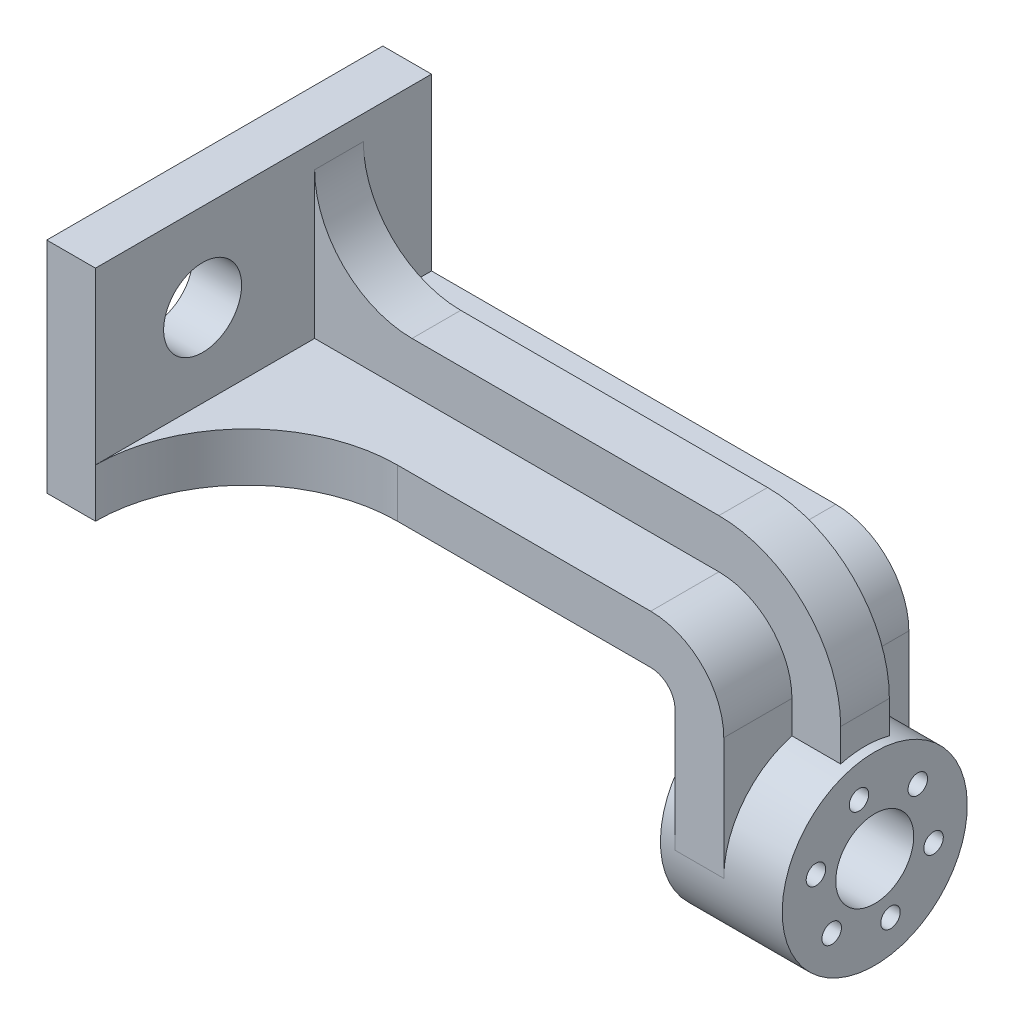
ISO-10303-21;
HEADER;
FILE_DESCRIPTION(('STEP AP214'),'2;1');
FILE_NAME('part.step','',(''),(''),'','','');
FILE_SCHEMA(('AUTOMOTIVE_DESIGN { 1 0 10303 214 1 1 1 1 }'));
ENDSEC;
DATA;
#1=APPLICATION_CONTEXT('core data for automotive mechanical design processes');
#2=APPLICATION_PROTOCOL_DEFINITION('international standard','automotive_design',2000,#1);
#3=PRODUCT_CONTEXT('',#1,'mechanical');
#4=PRODUCT('Part','Part','',(#3));
#5=PRODUCT_RELATED_PRODUCT_CATEGORY('part','',(#4));
#6=PRODUCT_DEFINITION_FORMATION('','',#4);
#7=PRODUCT_DEFINITION_CONTEXT('part definition',#1,'design');
#8=PRODUCT_DEFINITION('design','',#6,#7);
#9=PRODUCT_DEFINITION_SHAPE('','',#8);
#10=(LENGTH_UNIT() NAMED_UNIT(*) SI_UNIT(.MILLI.,.METRE.));
#11=(NAMED_UNIT(*) PLANE_ANGLE_UNIT() SI_UNIT($,.RADIAN.));
#12=(NAMED_UNIT(*) SI_UNIT($,.STERADIAN.) SOLID_ANGLE_UNIT());
#13=UNCERTAINTY_MEASURE_WITH_UNIT(LENGTH_MEASURE(1.E-05),#10,'distance_accuracy_value','');
#14=(GEOMETRIC_REPRESENTATION_CONTEXT(3) GLOBAL_UNCERTAINTY_ASSIGNED_CONTEXT((#13)) GLOBAL_UNIT_ASSIGNED_CONTEXT((#10,
#11,#12)) REPRESENTATION_CONTEXT('',''));
#15=CARTESIAN_POINT('',(0.,0.,0.));
#16=DIRECTION('',(0.,0.,1.));
#17=DIRECTION('',(1.,0.,0.));
#18=AXIS2_PLACEMENT_3D('',#15,#16,#17);
#19=CARTESIAN_POINT('',(108.,-52.5,3.49999999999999));
#20=DIRECTION('',(1.,0.,0.));
#21=DIRECTION('',(0.,1.,0.));
#22=AXIS2_PLACEMENT_3D('',#19,#20,#21);
#23=PLANE('',#22);
#24=CARTESIAN_POINT('',(108.,-52.5,-15.5));
#25=DIRECTION('',(1.,0.,0.));
#26=DIRECTION('',(0.,1.,0.));
#27=AXIS2_PLACEMENT_3D('',#24,#25,#26);
#28=CIRCLE('',#27,19.);
#29=CARTESIAN_POINT('',(108.,-34.1696972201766,-10.5));
#30=VERTEX_POINT('',#29);
#31=CARTESIAN_POINT('',(108.,-52.5,3.49999999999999));
#32=VERTEX_POINT('',#31);
#33=EDGE_CURVE('E278',#30,#32,#28,.T.);
#34=ORIENTED_EDGE('',*,*,#33,.F.);
#35=DIRECTION('',(0.,1.,0.));
#36=VECTOR('',#35,1.);
#37=CARTESIAN_POINT('',(108.,-52.5,-10.5));
#38=LINE('',#37,#36);
#39=CARTESIAN_POINT('',(108.,-27.5,-10.5));
#40=VERTEX_POINT('',#39);
#41=EDGE_CURVE('E208',#30,#40,#38,.T.);
#42=ORIENTED_EDGE('',*,*,#41,.T.);
#43=DIRECTION('',(0.,0.,-1.));
#44=VECTOR('',#43,1.);
#45=CARTESIAN_POINT('',(108.,-27.5,3.49999999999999));
#46=LINE('',#45,#44);
#47=CARTESIAN_POINT('',(108.,-27.5,3.49999999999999));
#48=VERTEX_POINT('',#47);
#49=EDGE_CURVE('E355',#40,#48,#46,.F.);
#50=ORIENTED_EDGE('',*,*,#49,.T.);
#51=DIRECTION('',(0.,-1.,0.));
#52=VECTOR('',#51,1.);
#53=CARTESIAN_POINT('',(108.,-52.5,3.49999999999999));
#54=LINE('',#53,#52);
#55=EDGE_CURVE('E288',#48,#32,#54,.T.);
#56=ORIENTED_EDGE('',*,*,#55,.T.);
#57=EDGE_LOOP('',(#34,#42,#50,#56));
#58=FACE_BOUND('',#57,.T.);
#59=ADVANCED_FACE('F34',(#58),#23,.T.);
#60=CARTESIAN_POINT('',(108.,-12.5,3.49999999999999));
#61=DIRECTION('',(0.,1.,0.));
#62=DIRECTION('',(0.,0.,1.));
#63=AXIS2_PLACEMENT_3D('',#60,#61,#62);
#64=PLANE('',#63);
#65=DIRECTION('',(0.,0.,-1.));
#66=VECTOR('',#65,1.);
#67=CARTESIAN_POINT('',(93.,-12.5,3.49999999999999));
#68=LINE('',#67,#66);
#69=CARTESIAN_POINT('',(93.,-12.5,3.49999999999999));
#70=VERTEX_POINT('',#69);
#71=CARTESIAN_POINT('',(93.,-12.5,-10.5));
#72=VERTEX_POINT('',#71);
#73=EDGE_CURVE('E350',#70,#72,#68,.T.);
#74=ORIENTED_EDGE('',*,*,#73,.T.);
#75=DIRECTION('',(-1.,0.,0.));
#76=VECTOR('',#75,1.);
#77=CARTESIAN_POINT('',(108.,-12.5,-10.5));
#78=LINE('',#77,#76);
#79=CARTESIAN_POINT('',(10.,-12.5,-10.5));
#80=VERTEX_POINT('',#79);
#81=EDGE_CURVE('E205',#72,#80,#78,.T.);
#82=ORIENTED_EDGE('',*,*,#81,.T.);
#83=DIRECTION('',(0.,0.,-1.));
#84=VECTOR('',#83,1.);
#85=CARTESIAN_POINT('',(10.,-12.5,3.49999999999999));
#86=LINE('',#85,#84);
#87=CARTESIAN_POINT('',(10.,-12.5,34.5));
#88=VERTEX_POINT('',#87);
#89=EDGE_CURVE('E311',#88,#80,#86,.T.);
#90=ORIENTED_EDGE('',*,*,#89,.F.);
#91=CARTESIAN_POINT('',(41.,-12.5,34.5));
#92=DIRECTION('',(0.,1.,0.));
#93=DIRECTION('',(0.,0.,1.));
#94=AXIS2_PLACEMENT_3D('',#91,#92,#93);
#95=CIRCLE('',#94,31.);
#96=CARTESIAN_POINT('',(41.,-12.5,3.49999999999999));
#97=VERTEX_POINT('',#96);
#98=EDGE_CURVE('E367',#88,#97,#95,.F.);
#99=ORIENTED_EDGE('',*,*,#98,.T.);
#100=DIRECTION('',(1.,0.,0.));
#101=VECTOR('',#100,1.);
#102=CARTESIAN_POINT('',(108.,-12.5,3.49999999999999));
#103=LINE('',#102,#101);
#104=EDGE_CURVE('E285',#97,#70,#103,.T.);
#105=ORIENTED_EDGE('',*,*,#104,.T.);
#106=EDGE_LOOP('',(#74,#82,#90,#99,#105));
#107=FACE_BOUND('',#106,.T.);
#108=ADVANCED_FACE('F401',(#107),#64,.T.);
#109=CARTESIAN_POINT('',(93.,-27.5,3.49999999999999));
#110=DIRECTION('',(0.,0.,-1.));
#111=DIRECTION('',(-1.,0.,0.));
#112=AXIS2_PLACEMENT_3D('',#109,#110,#111);
#113=CYLINDRICAL_SURFACE('',#112,15.);
#114=ORIENTED_EDGE('',*,*,#49,.F.);
#115=CARTESIAN_POINT('',(93.,-27.5,-10.5));
#116=DIRECTION('',(0.,0.,-1.));
#117=DIRECTION('',(-1.,0.,0.));
#118=AXIS2_PLACEMENT_3D('',#115,#116,#117);
#119=CIRCLE('',#118,15.);
#120=EDGE_CURVE('E371',#40,#72,#119,.F.);
#121=ORIENTED_EDGE('',*,*,#120,.T.);
#122=ORIENTED_EDGE('',*,*,#73,.F.);
#123=CARTESIAN_POINT('',(93.,-27.5,3.49999999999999));
#124=DIRECTION('',(0.,0.,1.));
#125=DIRECTION('',(1.,0.,0.));
#126=AXIS2_PLACEMENT_3D('',#123,#124,#125);
#127=CIRCLE('',#126,15.);
#128=EDGE_CURVE('E361',#48,#70,#127,.T.);
#129=ORIENTED_EDGE('',*,*,#128,.F.);
#130=EDGE_LOOP('',(#114,#121,#122,#129));
#131=FACE_BOUND('',#130,.T.);
#132=ADVANCED_FACE('F408',(#131),#113,.T.);
#133=CARTESIAN_POINT('',(10.,-22.5,-34.5));
#134=DIRECTION('',(0.,0.,1.));
#135=DIRECTION('',(1.,0.,0.));
#136=AXIS2_PLACEMENT_3D('',#133,#134,#135);
#137=PLANE('',#136);
#138=DIRECTION('',(1.,0.,0.));
#139=VECTOR('',#138,1.);
#140=CARTESIAN_POINT('',(108.,-12.5,-34.5));
#141=LINE('',#140,#139);
#142=CARTESIAN_POINT('',(10.,-12.5,-34.5));
#143=VERTEX_POINT('',#142);
#144=CARTESIAN_POINT('',(93.,-12.5,-34.5));
#145=VERTEX_POINT('',#144);
#146=EDGE_CURVE('E284',#143,#145,#141,.T.);
#147=ORIENTED_EDGE('',*,*,#146,.T.);
#148=CARTESIAN_POINT('',(93.,-27.5,-34.5));
#149=DIRECTION('',(0.,0.,1.));
#150=DIRECTION('',(1.,0.,0.));
#151=AXIS2_PLACEMENT_3D('',#148,#149,#150);
#152=CIRCLE('',#151,15.);
#153=CARTESIAN_POINT('',(108.,-27.5,-34.5));
#154=VERTEX_POINT('',#153);
#155=EDGE_CURVE('E353',#145,#154,#152,.F.);
#156=ORIENTED_EDGE('',*,*,#155,.T.);
#157=DIRECTION('',(0.,-1.,0.));
#158=VECTOR('',#157,1.);
#159=CARTESIAN_POINT('',(108.,-52.5,-34.5));
#160=LINE('',#159,#158);
#161=CARTESIAN_POINT('',(108.,-52.5,-34.5));
#162=VERTEX_POINT('',#161);
#163=EDGE_CURVE('E304',#154,#162,#160,.T.);
#164=ORIENTED_EDGE('',*,*,#163,.T.);
#165=DIRECTION('',(-1.,0.,0.));
#166=VECTOR('',#165,1.);
#167=CARTESIAN_POINT('',(98.,-52.5,-34.5));
#168=LINE('',#167,#166);
#169=CARTESIAN_POINT('',(98.,-52.5,-34.5));
#170=VERTEX_POINT('',#169);
#171=EDGE_CURVE('E306',#162,#170,#168,.T.);
#172=ORIENTED_EDGE('',*,*,#171,.T.);
#173=DIRECTION('',(0.,1.,0.));
#174=VECTOR('',#173,1.);
#175=CARTESIAN_POINT('',(98.,-22.5,-34.5));
#176=LINE('',#175,#174);
#177=CARTESIAN_POINT('',(98.,-27.5,-34.5));
#178=VERTEX_POINT('',#177);
#179=EDGE_CURVE('E289',#170,#178,#176,.T.);
#180=ORIENTED_EDGE('',*,*,#179,.T.);
#181=CARTESIAN_POINT('',(93.,-27.5,-34.5));
#182=DIRECTION('',(0.,0.,1.));
#183=DIRECTION('',(1.,0.,0.));
#184=AXIS2_PLACEMENT_3D('',#181,#182,#183);
#185=CIRCLE('',#184,5.);
#186=CARTESIAN_POINT('',(93.,-22.5,-34.5));
#187=VERTEX_POINT('',#186);
#188=EDGE_CURVE('E363',#178,#187,#185,.T.);
#189=ORIENTED_EDGE('',*,*,#188,.T.);
#190=DIRECTION('',(-1.,0.,0.));
#191=VECTOR('',#190,1.);
#192=CARTESIAN_POINT('',(10.,-22.5,-34.5));
#193=LINE('',#192,#191);
#194=CARTESIAN_POINT('',(0.,-22.5,-34.5));
#195=VERTEX_POINT('',#194);
#196=EDGE_CURVE('E324',#187,#195,#193,.T.);
#197=ORIENTED_EDGE('',*,*,#196,.T.);
#198=DIRECTION('',(0.,1.,0.));
#199=VECTOR('',#198,1.);
#200=CARTESIAN_POINT('',(0.,-22.5,-34.5));
#201=LINE('',#200,#199);
#202=CARTESIAN_POINT('',(0.,22.5,-34.5));
#203=VERTEX_POINT('',#202);
#204=EDGE_CURVE('E314',#195,#203,#201,.T.);
#205=ORIENTED_EDGE('',*,*,#204,.T.);
#206=DIRECTION('',(-1.,0.,0.));
#207=VECTOR('',#206,1.);
#208=CARTESIAN_POINT('',(10.,22.5,-34.5));
#209=LINE('',#208,#207);
#210=CARTESIAN_POINT('',(10.,22.5,-34.5));
#211=VERTEX_POINT('',#210);
#212=EDGE_CURVE('E340',#211,#203,#209,.T.);
#213=ORIENTED_EDGE('',*,*,#212,.F.);
#214=DIRECTION('',(0.,1.,0.));
#215=VECTOR('',#214,1.);
#216=CARTESIAN_POINT('',(10.,-22.5,-34.5));
#217=LINE('',#216,#215);
#218=EDGE_CURVE('E315',#143,#211,#217,.T.);
#219=ORIENTED_EDGE('',*,*,#218,.F.);
#220=EDGE_LOOP('',(#147,#156,#164,#172,#180,#189,#197,#205,#213,#219));
#221=FACE_BOUND('',#220,.T.);
#222=ADVANCED_FACE('F437',(#221),#137,.F.);
#223=CARTESIAN_POINT('',(10.,22.5,34.5));
#224=DIRECTION('',(0.,-1.,0.));
#225=DIRECTION('',(0.,0.,-1.));
#226=AXIS2_PLACEMENT_3D('',#223,#224,#225);
#227=PLANE('',#226);
#228=DIRECTION('',(0.,0.,1.));
#229=VECTOR('',#228,1.);
#230=CARTESIAN_POINT('',(0.,22.5,34.5));
#231=LINE('',#230,#229);
#232=CARTESIAN_POINT('',(0.,22.5,34.5));
#233=VERTEX_POINT('',#232);
#234=EDGE_CURVE('E327',#203,#233,#231,.T.);
#235=ORIENTED_EDGE('',*,*,#234,.T.);
#236=DIRECTION('',(-1.,0.,0.));
#237=VECTOR('',#236,1.);
#238=CARTESIAN_POINT('',(10.,22.5,34.5));
#239=LINE('',#238,#237);
#240=CARTESIAN_POINT('',(10.,22.5,34.5));
#241=VERTEX_POINT('',#240);
#242=EDGE_CURVE('E337',#241,#233,#239,.T.);
#243=ORIENTED_EDGE('',*,*,#242,.F.);
#244=DIRECTION('',(0.,0.,1.));
#245=VECTOR('',#244,1.);
#246=CARTESIAN_POINT('',(10.,22.5,34.5));
#247=LINE('',#246,#245);
#248=EDGE_CURVE('E317',#211,#241,#247,.T.);
#249=ORIENTED_EDGE('',*,*,#248,.F.);
#250=ORIENTED_EDGE('',*,*,#212,.T.);
#251=EDGE_LOOP('',(#235,#243,#249,#250));
#252=FACE_BOUND('',#251,.T.);
#253=ADVANCED_FACE('F448',(#252),#227,.F.);
#254=CARTESIAN_POINT('',(10.,-22.5,34.5));
#255=DIRECTION('',(0.,0.,-1.));
#256=DIRECTION('',(-1.,0.,0.));
#257=AXIS2_PLACEMENT_3D('',#254,#255,#256);
#258=PLANE('',#257);
#259=DIRECTION('',(0.,-1.,0.));
#260=VECTOR('',#259,1.);
#261=CARTESIAN_POINT('',(0.,-22.5,34.5));
#262=LINE('',#261,#260);
#263=CARTESIAN_POINT('',(0.,-22.5,34.5));
#264=VERTEX_POINT('',#263);
#265=EDGE_CURVE('E329',#233,#264,#262,.T.);
#266=ORIENTED_EDGE('',*,*,#265,.T.);
#267=DIRECTION('',(-1.,0.,0.));
#268=VECTOR('',#267,1.);
#269=CARTESIAN_POINT('',(10.,-22.5,34.5));
#270=LINE('',#269,#268);
#271=CARTESIAN_POINT('',(10.,-22.5,34.5));
#272=VERTEX_POINT('',#271);
#273=EDGE_CURVE('E334',#272,#264,#270,.T.);
#274=ORIENTED_EDGE('',*,*,#273,.F.);
#275=DIRECTION('',(0.,-1.,0.));
#276=VECTOR('',#275,1.);
#277=CARTESIAN_POINT('',(10.,-22.5,34.5));
#278=LINE('',#277,#276);
#279=EDGE_CURVE('E320',#88,#272,#278,.T.);
#280=ORIENTED_EDGE('',*,*,#279,.F.);
#281=EDGE_CURVE('E321',#241,#88,#278,.T.);
#282=ORIENTED_EDGE('',*,*,#281,.F.);
#283=ORIENTED_EDGE('',*,*,#242,.T.);
#284=EDGE_LOOP('',(#266,#274,#280,#282,#283));
#285=FACE_BOUND('',#284,.T.);
#286=ADVANCED_FACE('F457',(#285),#258,.F.);
#287=CARTESIAN_POINT('',(10.,-22.5,34.5));
#288=DIRECTION('',(0.,1.,0.));
#289=DIRECTION('',(0.,0.,1.));
#290=AXIS2_PLACEMENT_3D('',#287,#288,#289);
#291=PLANE('',#290);
#292=DIRECTION('',(0.,0.,-1.));
#293=VECTOR('',#292,1.);
#294=CARTESIAN_POINT('',(93.,-22.5,34.5));
#295=LINE('',#294,#293);
#296=CARTESIAN_POINT('',(93.,-22.5,3.49999999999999));
#297=VERTEX_POINT('',#296);
#298=EDGE_CURVE('E347',#187,#297,#295,.F.);
#299=ORIENTED_EDGE('',*,*,#298,.T.);
#300=DIRECTION('',(-1.,0.,0.));
#301=VECTOR('',#300,1.);
#302=CARTESIAN_POINT('',(10.,-22.5,3.49999999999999));
#303=LINE('',#302,#301);
#304=CARTESIAN_POINT('',(41.,-22.5,3.49999999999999));
#305=VERTEX_POINT('',#304);
#306=EDGE_CURVE('E298',#297,#305,#303,.T.);
#307=ORIENTED_EDGE('',*,*,#306,.T.);
#308=CARTESIAN_POINT('',(41.,-22.5,34.5));
#309=DIRECTION('',(0.,1.,0.));
#310=DIRECTION('',(0.,0.,1.));
#311=AXIS2_PLACEMENT_3D('',#308,#309,#310);
#312=CIRCLE('',#311,31.);
#313=EDGE_CURVE('E369',#305,#272,#312,.T.);
#314=ORIENTED_EDGE('',*,*,#313,.T.);
#315=ORIENTED_EDGE('',*,*,#273,.T.);
#316=DIRECTION('',(0.,0.,-1.));
#317=VECTOR('',#316,1.);
#318=CARTESIAN_POINT('',(0.,-22.5,34.5));
#319=LINE('',#318,#317);
#320=EDGE_CURVE('E318',#264,#195,#319,.T.);
#321=ORIENTED_EDGE('',*,*,#320,.T.);
#322=ORIENTED_EDGE('',*,*,#196,.F.);
#323=EDGE_LOOP('',(#299,#307,#314,#315,#321,#322));
#324=FACE_BOUND('',#323,.T.);
#325=ADVANCED_FACE('F470',(#324),#291,.F.);
#326=CARTESIAN_POINT('',(10.,0.,0.));
#327=DIRECTION('',(-1.,0.,0.));
#328=DIRECTION('',(0.,0.,1.));
#329=AXIS2_PLACEMENT_3D('',#326,#327,#328);
#330=PLANE('',#329);
#331=CARTESIAN_POINT('',(10.,4.50000000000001,12.5));
#332=DIRECTION('',(1.,0.,0.));
#333=DIRECTION('',(0.,0.,-1.));
#334=AXIS2_PLACEMENT_3D('',#331,#332,#333);
#335=CIRCLE('',#334,8.);
#336=CARTESIAN_POINT('',(10.,4.50000000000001,4.5));
#337=VERTEX_POINT('',#336);
#338=EDGE_CURVE('E226',#337,#337,#335,.T.);
#339=ORIENTED_EDGE('',*,*,#338,.F.);
#340=EDGE_LOOP('',(#339));
#341=FACE_BOUND('',#340,.T.);
#342=DIRECTION('',(0.,0.,1.));
#343=VECTOR('',#342,1.);
#344=CARTESIAN_POINT('',(10.,17.5,0.));
#345=LINE('',#344,#343);
#346=CARTESIAN_POINT('',(10.,17.5,-10.5));
#347=VERTEX_POINT('',#346);
#348=CARTESIAN_POINT('',(10.,17.5,-20.5));
#349=VERTEX_POINT('',#348);
#350=EDGE_CURVE('E376',#347,#349,#345,.F.);
#351=ORIENTED_EDGE('',*,*,#350,.T.);
#352=DIRECTION('',(0.,-1.,0.));
#353=VECTOR('',#352,1.);
#354=CARTESIAN_POINT('',(10.,0.,-20.5));
#355=LINE('',#354,#353);
#356=CARTESIAN_POINT('',(10.,-12.5,-20.5));
#357=VERTEX_POINT('',#356);
#358=EDGE_CURVE('E220',#349,#357,#355,.T.);
#359=ORIENTED_EDGE('',*,*,#358,.T.);
#360=EDGE_CURVE('E301',#357,#143,#86,.T.);
#361=ORIENTED_EDGE('',*,*,#360,.T.);
#362=ORIENTED_EDGE('',*,*,#218,.T.);
#363=ORIENTED_EDGE('',*,*,#248,.T.);
#364=ORIENTED_EDGE('',*,*,#281,.T.);
#365=ORIENTED_EDGE('',*,*,#89,.T.);
#366=DIRECTION('',(0.,-1.,0.));
#367=VECTOR('',#366,1.);
#368=CARTESIAN_POINT('',(10.,0.,-10.5));
#369=LINE('',#368,#367);
#370=EDGE_CURVE('E211',#347,#80,#369,.T.);
#371=ORIENTED_EDGE('',*,*,#370,.F.);
#372=EDGE_LOOP('',(#351,#359,#361,#362,#363,#364,#365,#371));
#373=FACE_BOUND('',#372,.T.);
#374=ADVANCED_FACE('F381',(#341,#373),#330,.F.);
#375=CARTESIAN_POINT('',(0.,0.,0.));
#376=DIRECTION('',(-1.,0.,0.));
#377=DIRECTION('',(0.,0.,1.));
#378=AXIS2_PLACEMENT_3D('',#375,#376,#377);
#379=PLANE('',#378);
#380=ORIENTED_EDGE('',*,*,#204,.F.);
#381=ORIENTED_EDGE('',*,*,#320,.F.);
#382=ORIENTED_EDGE('',*,*,#265,.F.);
#383=ORIENTED_EDGE('',*,*,#234,.F.);
#384=EDGE_LOOP('',(#380,#381,#382,#383));
#385=FACE_BOUND('',#384,.T.);
#386=CARTESIAN_POINT('',(0.,4.50000000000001,12.5));
#387=DIRECTION('',(-1.,0.,0.));
#388=DIRECTION('',(0.,0.,1.));
#389=AXIS2_PLACEMENT_3D('',#386,#387,#388);
#390=CIRCLE('',#389,8.);
#391=CARTESIAN_POINT('',(0.,4.50000000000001,20.5));
#392=VERTEX_POINT('',#391);
#393=EDGE_CURVE('E229',#392,#392,#390,.T.);
#394=ORIENTED_EDGE('',*,*,#393,.F.);
#395=EDGE_LOOP('',(#394));
#396=FACE_BOUND('',#395,.T.);
#397=ADVANCED_FACE('F423',(#385,#396),#379,.T.);
#398=CARTESIAN_POINT('',(98.,-22.5,3.49999999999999));
#399=DIRECTION('',(-1.,0.,0.));
#400=DIRECTION('',(0.,0.,1.));
#401=AXIS2_PLACEMENT_3D('',#398,#399,#400);
#402=PLANE('',#401);
#403=ORIENTED_EDGE('',*,*,#179,.F.);
#404=CARTESIAN_POINT('',(98.,-52.5,-15.5));
#405=DIRECTION('',(-1.,0.,0.));
#406=DIRECTION('',(0.,0.,1.));
#407=AXIS2_PLACEMENT_3D('',#404,#405,#406);
#408=CIRCLE('',#407,19.);
#409=CARTESIAN_POINT('',(98.,-52.5,3.49999999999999));
#410=VERTEX_POINT('',#409);
#411=EDGE_CURVE('E282',#410,#170,#408,.T.);
#412=ORIENTED_EDGE('',*,*,#411,.F.);
#413=DIRECTION('',(0.,1.,0.));
#414=VECTOR('',#413,1.);
#415=CARTESIAN_POINT('',(98.,-22.5,3.49999999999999));
#416=LINE('',#415,#414);
#417=CARTESIAN_POINT('',(98.,-27.5,3.49999999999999));
#418=VERTEX_POINT('',#417);
#419=EDGE_CURVE('E295',#410,#418,#416,.T.);
#420=ORIENTED_EDGE('',*,*,#419,.T.);
#421=DIRECTION('',(0.,0.,-1.));
#422=VECTOR('',#421,1.);
#423=CARTESIAN_POINT('',(98.,-27.5,3.49999999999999));
#424=LINE('',#423,#422);
#425=EDGE_CURVE('E343',#418,#178,#424,.T.);
#426=ORIENTED_EDGE('',*,*,#425,.T.);
#427=EDGE_LOOP('',(#403,#412,#420,#426));
#428=FACE_BOUND('',#427,.T.);
#429=ADVANCED_FACE('F415',(#428),#402,.T.);
#430=DIRECTION('',(0.,1.,0.));
#431=VECTOR('',#430,1.);
#432=CARTESIAN_POINT('',(108.,-52.5,-20.5));
#433=LINE('',#432,#431);
#434=CARTESIAN_POINT('',(108.,-34.1696972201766,-20.5));
#435=VERTEX_POINT('',#434);
#436=CARTESIAN_POINT('',(108.,-27.5,-20.5));
#437=VERTEX_POINT('',#436);
#438=EDGE_CURVE('E218',#435,#437,#433,.T.);
#439=ORIENTED_EDGE('',*,*,#438,.F.);
#440=EDGE_CURVE('E279',#162,#435,#28,.T.);
#441=ORIENTED_EDGE('',*,*,#440,.F.);
#442=ORIENTED_EDGE('',*,*,#163,.F.);
#443=EDGE_CURVE('E356',#154,#437,#46,.F.);
#444=ORIENTED_EDGE('',*,*,#443,.T.);
#445=EDGE_LOOP('',(#439,#441,#442,#444));
#446=FACE_BOUND('',#445,.T.);
#447=ADVANCED_FACE('F404',(#446),#23,.T.);
#448=DIRECTION('',(-1.,0.,0.));
#449=VECTOR('',#448,1.);
#450=CARTESIAN_POINT('',(108.,-12.5,-20.5));
#451=LINE('',#450,#449);
#452=CARTESIAN_POINT('',(93.,-12.5,-20.5));
#453=VERTEX_POINT('',#452);
#454=EDGE_CURVE('E216',#453,#357,#451,.T.);
#455=ORIENTED_EDGE('',*,*,#454,.F.);
#456=EDGE_CURVE('E349',#453,#145,#68,.T.);
#457=ORIENTED_EDGE('',*,*,#456,.T.);
#458=ORIENTED_EDGE('',*,*,#146,.F.);
#459=ORIENTED_EDGE('',*,*,#360,.F.);
#460=EDGE_LOOP('',(#455,#457,#458,#459));
#461=FACE_BOUND('',#460,.T.);
#462=ADVANCED_FACE('F411',(#461),#64,.T.);
#463=CARTESIAN_POINT('',(0.,0.,3.49999999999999));
#464=DIRECTION('',(0.,0.,1.));
#465=DIRECTION('',(1.,0.,0.));
#466=AXIS2_PLACEMENT_3D('',#463,#464,#465);
#467=PLANE('',#466);
#468=ORIENTED_EDGE('',*,*,#55,.F.);
#469=ORIENTED_EDGE('',*,*,#128,.T.);
#470=ORIENTED_EDGE('',*,*,#104,.F.);
#471=DIRECTION('',(0.,1.,0.));
#472=VECTOR('',#471,1.);
#473=CARTESIAN_POINT('',(41.,0.,3.49999999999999));
#474=LINE('',#473,#472);
#475=EDGE_CURVE('E359',#97,#305,#474,.F.);
#476=ORIENTED_EDGE('',*,*,#475,.T.);
#477=ORIENTED_EDGE('',*,*,#306,.F.);
#478=CARTESIAN_POINT('',(93.,-27.5,3.49999999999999));
#479=DIRECTION('',(0.,0.,1.));
#480=DIRECTION('',(1.,0.,0.));
#481=AXIS2_PLACEMENT_3D('',#478,#479,#480);
#482=CIRCLE('',#481,5.);
#483=EDGE_CURVE('E365',#297,#418,#482,.F.);
#484=ORIENTED_EDGE('',*,*,#483,.T.);
#485=ORIENTED_EDGE('',*,*,#419,.F.);
#486=DIRECTION('',(-1.,0.,0.));
#487=VECTOR('',#486,1.);
#488=CARTESIAN_POINT('',(98.,-52.5,3.49999999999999));
#489=LINE('',#488,#487);
#490=EDGE_CURVE('E292',#32,#410,#489,.T.);
#491=ORIENTED_EDGE('',*,*,#490,.F.);
#492=EDGE_LOOP('',(#468,#469,#470,#476,#477,#484,#485,#491));
#493=FACE_BOUND('',#492,.T.);
#494=ADVANCED_FACE('F421',(#493),#467,.T.);
#495=CARTESIAN_POINT('',(95.,-52.5,-15.5));
#496=DIRECTION('',(1.,0.,0.));
#497=DIRECTION('',(0.,1.,0.));
#498=AXIS2_PLACEMENT_3D('',#495,#496,#497);
#499=CYLINDRICAL_SURFACE('',#498,19.);
#500=CARTESIAN_POINT('',(95.,-52.5,-15.5));
#501=DIRECTION('',(1.,0.,0.));
#502=DIRECTION('',(0.,1.,0.));
#503=AXIS2_PLACEMENT_3D('',#500,#501,#502);
#504=CIRCLE('',#503,19.);
#505=CARTESIAN_POINT('',(95.,-33.5,-15.5));
#506=VERTEX_POINT('',#505);
#507=EDGE_CURVE('E275',#506,#506,#504,.T.);
#508=ORIENTED_EDGE('',*,*,#507,.T.);
#509=EDGE_LOOP('',(#508));
#510=FACE_BOUND('',#509,.T.);
#511=ORIENTED_EDGE('',*,*,#411,.T.);
#512=ORIENTED_EDGE('',*,*,#171,.F.);
#513=ORIENTED_EDGE('',*,*,#440,.T.);
#514=DIRECTION('',(1.,0.,0.));
#515=VECTOR('',#514,1.);
#516=CARTESIAN_POINT('',(95.,-34.1696972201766,-20.5));
#517=LINE('',#516,#515);
#518=CARTESIAN_POINT('',(118.,-34.1696972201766,-20.5));
#519=VERTEX_POINT('',#518);
#520=EDGE_CURVE('E223',#519,#435,#517,.F.);
#521=ORIENTED_EDGE('',*,*,#520,.F.);
#522=CARTESIAN_POINT('',(118.,-52.5,-15.5));
#523=DIRECTION('',(-1.,0.,0.));
#524=DIRECTION('',(0.,0.,1.));
#525=AXIS2_PLACEMENT_3D('',#522,#523,#524);
#526=CIRCLE('',#525,19.);
#527=CARTESIAN_POINT('',(118.,-34.1696972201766,-10.5));
#528=VERTEX_POINT('',#527);
#529=EDGE_CURVE('E182',#528,#519,#526,.T.);
#530=ORIENTED_EDGE('',*,*,#529,.F.);
#531=DIRECTION('',(1.,0.,0.));
#532=VECTOR('',#531,1.);
#533=CARTESIAN_POINT('',(95.,-34.1696972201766,-10.5));
#534=LINE('',#533,#532);
#535=EDGE_CURVE('E213',#528,#30,#534,.F.);
#536=ORIENTED_EDGE('',*,*,#535,.T.);
#537=ORIENTED_EDGE('',*,*,#33,.T.);
#538=ORIENTED_EDGE('',*,*,#490,.T.);
#539=EDGE_LOOP('',(#511,#512,#513,#521,#530,#536,#537,#538));
#540=FACE_BOUND('',#539,.T.);
#541=CARTESIAN_POINT('',(120.,-52.5,-15.5));
#542=DIRECTION('',(1.,0.,0.));
#543=DIRECTION('',(0.,1.,0.));
#544=AXIS2_PLACEMENT_3D('',#541,#542,#543);
#545=CIRCLE('',#544,19.);
#546=CARTESIAN_POINT('',(120.,-33.4999999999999,-15.5));
#547=VERTEX_POINT('',#546);
#548=EDGE_CURVE('E272',#547,#547,#545,.T.);
#549=ORIENTED_EDGE('',*,*,#548,.F.);
#550=EDGE_LOOP('',(#549));
#551=FACE_BOUND('',#550,.T.);
#552=ADVANCED_FACE('F432',(#510,#540,#551),#499,.T.);
#553=CARTESIAN_POINT('',(95.,-52.5,-15.5));
#554=DIRECTION('',(1.,0.,0.));
#555=DIRECTION('',(0.,1.,0.));
#556=AXIS2_PLACEMENT_3D('',#553,#554,#555);
#557=PLANE('',#556);
#558=CARTESIAN_POINT('',(95.,-64.5740728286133,-18.7352380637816));
#559=DIRECTION('',(1.,0.,0.));
#560=DIRECTION('',(0.,1.,0.));
#561=AXIS2_PLACEMENT_3D('',#558,#559,#560);
#562=CIRCLE('',#561,2.00000000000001);
#563=CARTESIAN_POINT('',(95.,-62.5740728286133,-18.7352380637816));
#564=VERTEX_POINT('',#563);
#565=EDGE_CURVE('E247',#564,#564,#562,.F.);
#566=ORIENTED_EDGE('',*,*,#565,.F.);
#567=EDGE_LOOP('',(#566));
#568=FACE_BOUND('',#567,.T.);
#569=CARTESIAN_POINT('',(95.,-52.5,-15.5));
#570=DIRECTION('',(1.,0.,0.));
#571=DIRECTION('',(0.,1.,0.));
#572=AXIS2_PLACEMENT_3D('',#569,#570,#571);
#573=CIRCLE('',#572,8.);
#574=CARTESIAN_POINT('',(95.,-44.5,-15.5));
#575=VERTEX_POINT('',#574);
#576=EDGE_CURVE('E269',#575,#575,#573,.F.);
#577=ORIENTED_EDGE('',*,*,#576,.F.);
#578=EDGE_LOOP('',(#577));
#579=FACE_BOUND('',#578,.T.);
#580=ORIENTED_EDGE('',*,*,#507,.F.);
#581=EDGE_LOOP('',(#580));
#582=FACE_BOUND('',#581,.T.);
#583=CARTESIAN_POINT('',(95.,-55.7352380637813,-27.5740728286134));
#584=DIRECTION('',(1.,0.,0.));
#585=DIRECTION('',(0.,1.,0.));
#586=AXIS2_PLACEMENT_3D('',#583,#584,#585);
#587=CIRCLE('',#586,2.00000000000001);
#588=CARTESIAN_POINT('',(95.,-53.7352380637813,-27.5740728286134));
#589=VERTEX_POINT('',#588);
#590=EDGE_CURVE('E253',#589,#589,#587,.F.);
#591=ORIENTED_EDGE('',*,*,#590,.F.);
#592=EDGE_LOOP('',(#591));
#593=FACE_BOUND('',#592,.T.);
#594=CARTESIAN_POINT('',(95.,-43.6611652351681,-24.3388347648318));
#595=DIRECTION('',(1.,0.,0.));
#596=DIRECTION('',(0.,1.,0.));
#597=AXIS2_PLACEMENT_3D('',#594,#595,#596);
#598=CIRCLE('',#597,2.00000000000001);
#599=CARTESIAN_POINT('',(95.,-41.6611652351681,-24.3388347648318));
#600=VERTEX_POINT('',#599);
#601=EDGE_CURVE('E263',#600,#600,#598,.F.);
#602=ORIENTED_EDGE('',*,*,#601,.F.);
#603=EDGE_LOOP('',(#602));
#604=FACE_BOUND('',#603,.T.);
#605=CARTESIAN_POINT('',(95.,-40.4259271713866,-12.2647619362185));
#606=DIRECTION('',(1.,0.,0.));
#607=DIRECTION('',(0.,1.,0.));
#608=AXIS2_PLACEMENT_3D('',#605,#606,#607);
#609=CIRCLE('',#608,2.00000000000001);
#610=CARTESIAN_POINT('',(95.,-38.4259271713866,-12.2647619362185));
#611=VERTEX_POINT('',#610);
#612=EDGE_CURVE('E233',#611,#611,#609,.F.);
#613=ORIENTED_EDGE('',*,*,#612,.F.);
#614=EDGE_LOOP('',(#613));
#615=FACE_BOUND('',#614,.T.);
#616=CARTESIAN_POINT('',(95.,-61.3388347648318,-6.66116523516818));
#617=DIRECTION('',(1.,0.,0.));
#618=DIRECTION('',(0.,1.,0.));
#619=AXIS2_PLACEMENT_3D('',#616,#617,#618);
#620=CIRCLE('',#619,2.00000000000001);
#621=CARTESIAN_POINT('',(95.,-59.3388347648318,-6.66116523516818));
#622=VERTEX_POINT('',#621);
#623=EDGE_CURVE('E241',#622,#622,#620,.F.);
#624=ORIENTED_EDGE('',*,*,#623,.F.);
#625=EDGE_LOOP('',(#624));
#626=FACE_BOUND('',#625,.T.);
#627=CARTESIAN_POINT('',(95.,-49.2647619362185,-3.42592717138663));
#628=DIRECTION('',(1.,0.,0.));
#629=DIRECTION('',(0.,1.,0.));
#630=AXIS2_PLACEMENT_3D('',#627,#628,#629);
#631=CIRCLE('',#630,2.00000000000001);
#632=CARTESIAN_POINT('',(95.,-47.2647619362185,-3.42592717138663));
#633=VERTEX_POINT('',#632);
#634=EDGE_CURVE('E234',#633,#633,#631,.F.);
#635=ORIENTED_EDGE('',*,*,#634,.F.);
#636=EDGE_LOOP('',(#635));
#637=FACE_BOUND('',#636,.T.);
#638=ADVANCED_FACE('F546',(#568,#579,#582,#593,#604,#615,#626,#637),#557,.F.);
#639=CARTESIAN_POINT('',(120.,-52.5,-15.5));
#640=DIRECTION('',(1.,0.,0.));
#641=DIRECTION('',(0.,1.,0.));
#642=AXIS2_PLACEMENT_3D('',#639,#640,#641);
#643=PLANE('',#642);
#644=CARTESIAN_POINT('',(120.,-40.4259271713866,-12.2647619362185));
#645=DIRECTION('',(1.,0.,0.));
#646=DIRECTION('',(0.,0.499999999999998,0.86602540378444));
#647=AXIS2_PLACEMENT_3D('',#644,#645,#646);
#648=CIRCLE('',#647,2.00000000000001);
#649=CARTESIAN_POINT('',(120.,-39.4259271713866,-10.5327111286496));
#650=VERTEX_POINT('',#649);
#651=EDGE_CURVE('E230',#650,#650,#648,.T.);
#652=ORIENTED_EDGE('',*,*,#651,.F.);
#653=EDGE_LOOP('',(#652));
#654=FACE_BOUND('',#653,.T.);
#655=CARTESIAN_POINT('',(120.,-49.2647619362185,-3.42592717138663));
#656=DIRECTION('',(1.,0.,0.));
#657=DIRECTION('',(0.,-0.500000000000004,0.866025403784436));
#658=AXIS2_PLACEMENT_3D('',#655,#656,#657);
#659=CIRCLE('',#658,2.00000000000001);
#660=CARTESIAN_POINT('',(120.,-50.2647619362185,-1.69387636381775));
#661=VERTEX_POINT('',#660);
#662=EDGE_CURVE('E238',#661,#661,#659,.T.);
#663=ORIENTED_EDGE('',*,*,#662,.F.);
#664=EDGE_LOOP('',(#663));
#665=FACE_BOUND('',#664,.T.);
#666=CARTESIAN_POINT('',(120.,-61.3388347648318,-6.66116523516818));
#667=DIRECTION('',(1.,0.,0.));
#668=DIRECTION('',(0.,-1.,0.));
#669=AXIS2_PLACEMENT_3D('',#666,#667,#668);
#670=CIRCLE('',#669,2.00000000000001);
#671=CARTESIAN_POINT('',(120.,-59.3388347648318,-6.66116523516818));
#672=VERTEX_POINT('',#671);
#673=EDGE_CURVE('E244',#672,#672,#670,.T.);
#674=ORIENTED_EDGE('',*,*,#673,.F.);
#675=EDGE_LOOP('',(#674));
#676=FACE_BOUND('',#675,.T.);
#677=CARTESIAN_POINT('',(120.,-64.5740728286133,-18.7352380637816));
#678=DIRECTION('',(1.,0.,0.));
#679=DIRECTION('',(0.,-0.499999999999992,-0.866025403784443));
#680=AXIS2_PLACEMENT_3D('',#677,#678,#679);
#681=CIRCLE('',#680,2.00000000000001);
#682=CARTESIAN_POINT('',(120.,-62.5740728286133,-18.7352380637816));
#683=VERTEX_POINT('',#682);
#684=EDGE_CURVE('E250',#683,#683,#681,.T.);
#685=ORIENTED_EDGE('',*,*,#684,.F.);
#686=EDGE_LOOP('',(#685));
#687=FACE_BOUND('',#686,.T.);
#688=CARTESIAN_POINT('',(120.,-55.7352380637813,-27.5740728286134));
#689=DIRECTION('',(1.,0.,0.));
#690=DIRECTION('',(0.,0.50000000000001,-0.866025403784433));
#691=AXIS2_PLACEMENT_3D('',#688,#689,#690);
#692=CIRCLE('',#691,2.00000000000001);
#693=CARTESIAN_POINT('',(120.,-53.7352380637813,-27.5740728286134));
#694=VERTEX_POINT('',#693);
#695=EDGE_CURVE('E256',#694,#694,#692,.T.);
#696=ORIENTED_EDGE('',*,*,#695,.F.);
#697=EDGE_LOOP('',(#696));
#698=FACE_BOUND('',#697,.T.);
#699=CARTESIAN_POINT('',(120.,-43.6611652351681,-24.3388347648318));
#700=DIRECTION('',(1.,0.,0.));
#701=DIRECTION('',(0.,1.,0.));
#702=AXIS2_PLACEMENT_3D('',#699,#700,#701);
#703=CIRCLE('',#702,2.00000000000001);
#704=CARTESIAN_POINT('',(120.,-41.6611652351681,-24.3388347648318));
#705=VERTEX_POINT('',#704);
#706=EDGE_CURVE('E237',#705,#705,#703,.T.);
#707=ORIENTED_EDGE('',*,*,#706,.F.);
#708=EDGE_LOOP('',(#707));
#709=FACE_BOUND('',#708,.T.);
#710=CARTESIAN_POINT('',(120.,-52.5,-15.5));
#711=DIRECTION('',(1.,0.,0.));
#712=DIRECTION('',(0.,1.,0.));
#713=AXIS2_PLACEMENT_3D('',#710,#711,#712);
#714=CIRCLE('',#713,8.);
#715=CARTESIAN_POINT('',(120.,-44.5,-15.5));
#716=VERTEX_POINT('',#715);
#717=EDGE_CURVE('E266',#716,#716,#714,.T.);
#718=ORIENTED_EDGE('',*,*,#717,.F.);
#719=EDGE_LOOP('',(#718));
#720=FACE_BOUND('',#719,.T.);
#721=ORIENTED_EDGE('',*,*,#548,.T.);
#722=EDGE_LOOP('',(#721));
#723=FACE_BOUND('',#722,.T.);
#724=ADVANCED_FACE('F556',(#654,#665,#676,#687,#698,#709,#720,#723),#643,.T.);
#725=CARTESIAN_POINT('',(-0.00100000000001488,-52.5,-15.5));
#726=DIRECTION('',(1.,0.,0.));
#727=DIRECTION('',(0.,1.,0.));
#728=AXIS2_PLACEMENT_3D('',#725,#726,#727);
#729=CYLINDRICAL_SURFACE('',#728,8.);
#730=CARTESIAN_POINT('',(95.,-44.5,-15.5));
#731=CARTESIAN_POINT('',(95.2604166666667,-44.5,-15.5));
#732=CARTESIAN_POINT('',(95.5208333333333,-44.5,-15.5));
#733=CARTESIAN_POINT('',(96.0416666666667,-44.5,-15.5));
#734=CARTESIAN_POINT('',(96.3020833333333,-44.5,-15.5));
#735=CARTESIAN_POINT('',(96.8229166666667,-44.5,-15.5));
#736=CARTESIAN_POINT('',(97.0833333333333,-44.5,-15.5));
#737=CARTESIAN_POINT('',(97.6041666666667,-44.5,-15.5));
#738=CARTESIAN_POINT('',(97.8645833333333,-44.5,-15.5));
#739=CARTESIAN_POINT('',(98.3854166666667,-44.5,-15.5));
#740=CARTESIAN_POINT('',(98.6458333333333,-44.5,-15.5));
#741=CARTESIAN_POINT('',(99.1666666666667,-44.5,-15.5));
#742=CARTESIAN_POINT('',(99.4270833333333,-44.5,-15.5));
#743=CARTESIAN_POINT('',(99.9479166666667,-44.5,-15.5));
#744=CARTESIAN_POINT('',(100.208333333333,-44.5,-15.5));
#745=CARTESIAN_POINT('',(100.729166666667,-44.5,-15.5));
#746=CARTESIAN_POINT('',(100.989583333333,-44.5,-15.5));
#747=CARTESIAN_POINT('',(101.510416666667,-44.5,-15.5));
#748=CARTESIAN_POINT('',(101.770833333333,-44.5,-15.5));
#749=CARTESIAN_POINT('',(102.291666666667,-44.5,-15.5));
#750=CARTESIAN_POINT('',(102.552083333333,-44.5,-15.5));
#751=CARTESIAN_POINT('',(103.072916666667,-44.5,-15.5));
#752=CARTESIAN_POINT('',(103.333333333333,-44.5,-15.5));
#753=CARTESIAN_POINT('',(103.854166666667,-44.5,-15.5));
#754=CARTESIAN_POINT('',(104.114583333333,-44.5,-15.5));
#755=CARTESIAN_POINT('',(104.635416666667,-44.5,-15.5));
#756=CARTESIAN_POINT('',(104.895833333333,-44.5,-15.5));
#757=CARTESIAN_POINT('',(105.416666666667,-44.5,-15.5));
#758=CARTESIAN_POINT('',(105.677083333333,-44.5,-15.5));
#759=CARTESIAN_POINT('',(106.197916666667,-44.5,-15.5));
#760=CARTESIAN_POINT('',(106.458333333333,-44.5,-15.5));
#761=CARTESIAN_POINT('',(106.979166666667,-44.5,-15.5));
#762=CARTESIAN_POINT('',(107.239583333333,-44.5,-15.5));
#763=CARTESIAN_POINT('',(107.760416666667,-44.5,-15.5));
#764=CARTESIAN_POINT('',(108.020833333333,-44.5,-15.5));
#765=CARTESIAN_POINT('',(108.541666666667,-44.5,-15.5));
#766=CARTESIAN_POINT('',(108.802083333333,-44.5,-15.5));
#767=CARTESIAN_POINT('',(109.322916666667,-44.5,-15.5));
#768=CARTESIAN_POINT('',(109.583333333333,-44.5,-15.5));
#769=CARTESIAN_POINT('',(110.104166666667,-44.5,-15.5));
#770=CARTESIAN_POINT('',(110.364583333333,-44.5,-15.5));
#771=CARTESIAN_POINT('',(110.885416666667,-44.5,-15.5));
#772=CARTESIAN_POINT('',(111.145833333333,-44.5,-15.5));
#773=CARTESIAN_POINT('',(111.666666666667,-44.5,-15.5));
#774=CARTESIAN_POINT('',(111.927083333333,-44.5,-15.5));
#775=CARTESIAN_POINT('',(112.447916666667,-44.5,-15.5));
#776=CARTESIAN_POINT('',(112.708333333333,-44.5,-15.5));
#777=CARTESIAN_POINT('',(113.229166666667,-44.5,-15.5));
#778=CARTESIAN_POINT('',(113.489583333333,-44.5,-15.5));
#779=CARTESIAN_POINT('',(114.010416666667,-44.5,-15.5));
#780=CARTESIAN_POINT('',(114.270833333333,-44.5,-15.5));
#781=CARTESIAN_POINT('',(114.791666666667,-44.5,-15.5));
#782=CARTESIAN_POINT('',(115.052083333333,-44.5,-15.5));
#783=CARTESIAN_POINT('',(115.572916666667,-44.5,-15.5));
#784=CARTESIAN_POINT('',(115.833333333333,-44.5,-15.5));
#785=CARTESIAN_POINT('',(116.354166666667,-44.5,-15.5));
#786=CARTESIAN_POINT('',(116.614583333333,-44.5,-15.5));
#787=CARTESIAN_POINT('',(117.135416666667,-44.5,-15.5));
#788=CARTESIAN_POINT('',(117.395833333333,-44.5,-15.5));
#789=CARTESIAN_POINT('',(117.916666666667,-44.5,-15.5));
#790=CARTESIAN_POINT('',(118.177083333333,-44.5,-15.5));
#791=CARTESIAN_POINT('',(118.697916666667,-44.5,-15.5));
#792=CARTESIAN_POINT('',(118.958333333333,-44.5,-15.5));
#793=CARTESIAN_POINT('',(119.479166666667,-44.5,-15.5));
#794=CARTESIAN_POINT('',(119.739583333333,-44.5,-15.5));
#795=CARTESIAN_POINT('',(120.,-44.5,-15.5));
#796=B_SPLINE_CURVE_WITH_KNOTS('',3,(#730,#731,#732,#733,#734,#735,#736,#737,#738,#739,#740,
#741,#742,#743,#744,#745,#746,#747,#748,#749,#750,#751,#752,#753,#754,#755,#756,#757,#758,#759,
#760,#761,#762,#763,#764,#765,#766,#767,#768,#769,#770,#771,#772,#773,#774,#775,#776,#777,#778,
#779,#780,#781,#782,#783,#784,#785,#786,#787,#788,#789,#790,#791,#792,#793,#794,#795),
.UNSPECIFIED.,.F.,.F.,(4,2,2,2,2,2,2,2,2,2,2,2,2,2,2,2,2,2,2,2,2,2,2,2,2,2,2,2,2,2,2,2,4),(0.,
0.781249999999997,1.56249999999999,2.34375000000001,3.125,3.90625,4.6875,5.46874999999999,
6.25000000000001,7.03125,7.8125,8.59375,9.37499999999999,10.15625,10.9375,11.71875,12.5,
13.28125,14.0625,14.84375,15.625,16.40625,17.1875,17.96875,18.75,19.53125,20.3125,21.09375,
21.875,22.65625,23.4375,24.21875,25.),.UNSPECIFIED.);
#797=EDGE_CURVE('BSEAM564',#575,#716,#796,.T.);
#798=ORIENTED_EDGE('',*,*,#576,.T.);
#799=ORIENTED_EDGE('',*,*,#717,.T.);
#800=ORIENTED_EDGE('',*,*,#797,.T.);
#801=ORIENTED_EDGE('',*,*,#797,.F.);
#802=EDGE_LOOP('',(#798,#800,#799,#801));
#803=FACE_BOUND('',#802,.T.);
#804=ADVANCED_FACE('F564',(#803),#729,.F.);
#805=CARTESIAN_POINT('',(-0.00100000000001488,-43.6611652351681,-24.3388347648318));
#806=DIRECTION('',(1.,0.,0.));
#807=DIRECTION('',(0.,1.,0.));
#808=AXIS2_PLACEMENT_3D('',#805,#806,#807);
#809=CYLINDRICAL_SURFACE('',#808,2.00000000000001);
#810=CARTESIAN_POINT('',(120.,-41.6611652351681,-24.3388347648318));
#811=CARTESIAN_POINT('',(119.739583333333,-41.6611652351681,-24.3388347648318));
#812=CARTESIAN_POINT('',(119.479166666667,-41.6611652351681,-24.3388347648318));
#813=CARTESIAN_POINT('',(118.958333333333,-41.6611652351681,-24.3388347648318));
#814=CARTESIAN_POINT('',(118.697916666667,-41.6611652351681,-24.3388347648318));
#815=CARTESIAN_POINT('',(118.177083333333,-41.6611652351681,-24.3388347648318));
#816=CARTESIAN_POINT('',(117.916666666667,-41.6611652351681,-24.3388347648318));
#817=CARTESIAN_POINT('',(117.395833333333,-41.6611652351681,-24.3388347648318));
#818=CARTESIAN_POINT('',(117.135416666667,-41.6611652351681,-24.3388347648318));
#819=CARTESIAN_POINT('',(116.614583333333,-41.6611652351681,-24.3388347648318));
#820=CARTESIAN_POINT('',(116.354166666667,-41.6611652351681,-24.3388347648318));
#821=CARTESIAN_POINT('',(115.833333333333,-41.6611652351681,-24.3388347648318));
#822=CARTESIAN_POINT('',(115.572916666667,-41.6611652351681,-24.3388347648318));
#823=CARTESIAN_POINT('',(115.052083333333,-41.6611652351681,-24.3388347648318));
#824=CARTESIAN_POINT('',(114.791666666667,-41.6611652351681,-24.3388347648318));
#825=CARTESIAN_POINT('',(114.270833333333,-41.6611652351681,-24.3388347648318));
#826=CARTESIAN_POINT('',(114.010416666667,-41.6611652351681,-24.3388347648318));
#827=CARTESIAN_POINT('',(113.489583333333,-41.6611652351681,-24.3388347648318));
#828=CARTESIAN_POINT('',(113.229166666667,-41.6611652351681,-24.3388347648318));
#829=CARTESIAN_POINT('',(112.708333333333,-41.6611652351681,-24.3388347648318));
#830=CARTESIAN_POINT('',(112.447916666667,-41.6611652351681,-24.3388347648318));
#831=CARTESIAN_POINT('',(111.927083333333,-41.6611652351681,-24.3388347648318));
#832=CARTESIAN_POINT('',(111.666666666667,-41.6611652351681,-24.3388347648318));
#833=CARTESIAN_POINT('',(111.145833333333,-41.6611652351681,-24.3388347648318));
#834=CARTESIAN_POINT('',(110.885416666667,-41.6611652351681,-24.3388347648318));
#835=CARTESIAN_POINT('',(110.364583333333,-41.6611652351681,-24.3388347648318));
#836=CARTESIAN_POINT('',(110.104166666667,-41.6611652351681,-24.3388347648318));
#837=CARTESIAN_POINT('',(109.583333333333,-41.6611652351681,-24.3388347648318));
#838=CARTESIAN_POINT('',(109.322916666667,-41.6611652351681,-24.3388347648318));
#839=CARTESIAN_POINT('',(108.802083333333,-41.6611652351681,-24.3388347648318));
#840=CARTESIAN_POINT('',(108.541666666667,-41.6611652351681,-24.3388347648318));
#841=CARTESIAN_POINT('',(108.020833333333,-41.6611652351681,-24.3388347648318));
#842=CARTESIAN_POINT('',(107.760416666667,-41.6611652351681,-24.3388347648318));
#843=CARTESIAN_POINT('',(107.239583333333,-41.6611652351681,-24.3388347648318));
#844=CARTESIAN_POINT('',(106.979166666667,-41.6611652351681,-24.3388347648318));
#845=CARTESIAN_POINT('',(106.458333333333,-41.6611652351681,-24.3388347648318));
#846=CARTESIAN_POINT('',(106.197916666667,-41.6611652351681,-24.3388347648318));
#847=CARTESIAN_POINT('',(105.677083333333,-41.6611652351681,-24.3388347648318));
#848=CARTESIAN_POINT('',(105.416666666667,-41.6611652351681,-24.3388347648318));
#849=CARTESIAN_POINT('',(104.895833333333,-41.6611652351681,-24.3388347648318));
#850=CARTESIAN_POINT('',(104.635416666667,-41.6611652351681,-24.3388347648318));
#851=CARTESIAN_POINT('',(104.114583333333,-41.6611652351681,-24.3388347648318));
#852=CARTESIAN_POINT('',(103.854166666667,-41.6611652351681,-24.3388347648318));
#853=CARTESIAN_POINT('',(103.333333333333,-41.6611652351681,-24.3388347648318));
#854=CARTESIAN_POINT('',(103.072916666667,-41.6611652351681,-24.3388347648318));
#855=CARTESIAN_POINT('',(102.552083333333,-41.6611652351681,-24.3388347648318));
#856=CARTESIAN_POINT('',(102.291666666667,-41.6611652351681,-24.3388347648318));
#857=CARTESIAN_POINT('',(101.770833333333,-41.6611652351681,-24.3388347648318));
#858=CARTESIAN_POINT('',(101.510416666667,-41.6611652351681,-24.3388347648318));
#859=CARTESIAN_POINT('',(100.989583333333,-41.6611652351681,-24.3388347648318));
#860=CARTESIAN_POINT('',(100.729166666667,-41.6611652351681,-24.3388347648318));
#861=CARTESIAN_POINT('',(100.208333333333,-41.6611652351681,-24.3388347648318));
#862=CARTESIAN_POINT('',(99.9479166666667,-41.6611652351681,-24.3388347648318));
#863=CARTESIAN_POINT('',(99.4270833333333,-41.6611652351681,-24.3388347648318));
#864=CARTESIAN_POINT('',(99.1666666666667,-41.6611652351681,-24.3388347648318));
#865=CARTESIAN_POINT('',(98.6458333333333,-41.6611652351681,-24.3388347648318));
#866=CARTESIAN_POINT('',(98.3854166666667,-41.6611652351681,-24.3388347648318));
#867=CARTESIAN_POINT('',(97.8645833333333,-41.6611652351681,-24.3388347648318));
#868=CARTESIAN_POINT('',(97.6041666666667,-41.6611652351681,-24.3388347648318));
#869=CARTESIAN_POINT('',(97.0833333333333,-41.6611652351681,-24.3388347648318));
#870=CARTESIAN_POINT('',(96.8229166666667,-41.6611652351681,-24.3388347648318));
#871=CARTESIAN_POINT('',(96.3020833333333,-41.6611652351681,-24.3388347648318));
#872=CARTESIAN_POINT('',(96.0416666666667,-41.6611652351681,-24.3388347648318));
#873=CARTESIAN_POINT('',(95.5208333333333,-41.6611652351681,-24.3388347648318));
#874=CARTESIAN_POINT('',(95.2604166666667,-41.6611652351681,-24.3388347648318));
#875=CARTESIAN_POINT('',(95.,-41.6611652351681,-24.3388347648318));
#876=B_SPLINE_CURVE_WITH_KNOTS('',3,(#810,#811,#812,#813,#814,#815,#816,#817,#818,#819,#820,
#821,#822,#823,#824,#825,#826,#827,#828,#829,#830,#831,#832,#833,#834,#835,#836,#837,#838,#839,
#840,#841,#842,#843,#844,#845,#846,#847,#848,#849,#850,#851,#852,#853,#854,#855,#856,#857,#858,
#859,#860,#861,#862,#863,#864,#865,#866,#867,#868,#869,#870,#871,#872,#873,#874,#875),
.UNSPECIFIED.,.F.,.F.,(4,2,2,2,2,2,2,2,2,2,2,2,2,2,2,2,2,2,2,2,2,2,2,2,2,2,2,2,2,2,2,2,4),(0.,
0.781249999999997,1.56249999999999,2.34375000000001,3.125,3.90625,4.6875,5.46874999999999,
6.25000000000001,7.03125,7.8125,8.59375,9.37499999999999,10.15625,10.9375,11.71875,12.5,
13.28125,14.0625,14.84375,15.625,16.40625,17.1875,17.96875,18.75,19.53125,20.3125,21.09375,
21.875,22.65625,23.4375,24.21875,25.),.UNSPECIFIED.);
#877=EDGE_CURVE('BSEAM569',#705,#600,#876,.T.);
#878=ORIENTED_EDGE('',*,*,#706,.T.);
#879=ORIENTED_EDGE('',*,*,#601,.T.);
#880=ORIENTED_EDGE('',*,*,#877,.T.);
#881=ORIENTED_EDGE('',*,*,#877,.F.);
#882=EDGE_LOOP('',(#878,#880,#879,#881));
#883=FACE_BOUND('',#882,.T.);
#884=ADVANCED_FACE('F569',(#883),#809,.F.);
#885=CARTESIAN_POINT('',(-0.001000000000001,-55.7352380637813,-27.5740728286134));
#886=DIRECTION('',(1.,0.,0.));
#887=DIRECTION('',(0.,1.,0.));
#888=AXIS2_PLACEMENT_3D('',#885,#886,#887);
#889=CYLINDRICAL_SURFACE('',#888,2.00000000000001);
#890=CARTESIAN_POINT('',(120.,-53.7352380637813,-27.5740728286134));
#891=CARTESIAN_POINT('',(119.739583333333,-53.7352380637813,-27.5740728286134));
#892=CARTESIAN_POINT('',(119.479166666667,-53.7352380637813,-27.5740728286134));
#893=CARTESIAN_POINT('',(118.958333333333,-53.7352380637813,-27.5740728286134));
#894=CARTESIAN_POINT('',(118.697916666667,-53.7352380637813,-27.5740728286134));
#895=CARTESIAN_POINT('',(118.177083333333,-53.7352380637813,-27.5740728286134));
#896=CARTESIAN_POINT('',(117.916666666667,-53.7352380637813,-27.5740728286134));
#897=CARTESIAN_POINT('',(117.395833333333,-53.7352380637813,-27.5740728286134));
#898=CARTESIAN_POINT('',(117.135416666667,-53.7352380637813,-27.5740728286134));
#899=CARTESIAN_POINT('',(116.614583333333,-53.7352380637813,-27.5740728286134));
#900=CARTESIAN_POINT('',(116.354166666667,-53.7352380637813,-27.5740728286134));
#901=CARTESIAN_POINT('',(115.833333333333,-53.7352380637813,-27.5740728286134));
#902=CARTESIAN_POINT('',(115.572916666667,-53.7352380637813,-27.5740728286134));
#903=CARTESIAN_POINT('',(115.052083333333,-53.7352380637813,-27.5740728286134));
#904=CARTESIAN_POINT('',(114.791666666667,-53.7352380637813,-27.5740728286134));
#905=CARTESIAN_POINT('',(114.270833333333,-53.7352380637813,-27.5740728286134));
#906=CARTESIAN_POINT('',(114.010416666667,-53.7352380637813,-27.5740728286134));
#907=CARTESIAN_POINT('',(113.489583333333,-53.7352380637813,-27.5740728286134));
#908=CARTESIAN_POINT('',(113.229166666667,-53.7352380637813,-27.5740728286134));
#909=CARTESIAN_POINT('',(112.708333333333,-53.7352380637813,-27.5740728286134));
#910=CARTESIAN_POINT('',(112.447916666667,-53.7352380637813,-27.5740728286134));
#911=CARTESIAN_POINT('',(111.927083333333,-53.7352380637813,-27.5740728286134));
#912=CARTESIAN_POINT('',(111.666666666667,-53.7352380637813,-27.5740728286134));
#913=CARTESIAN_POINT('',(111.145833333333,-53.7352380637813,-27.5740728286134));
#914=CARTESIAN_POINT('',(110.885416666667,-53.7352380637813,-27.5740728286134));
#915=CARTESIAN_POINT('',(110.364583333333,-53.7352380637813,-27.5740728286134));
#916=CARTESIAN_POINT('',(110.104166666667,-53.7352380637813,-27.5740728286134));
#917=CARTESIAN_POINT('',(109.583333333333,-53.7352380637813,-27.5740728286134));
#918=CARTESIAN_POINT('',(109.322916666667,-53.7352380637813,-27.5740728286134));
#919=CARTESIAN_POINT('',(108.802083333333,-53.7352380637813,-27.5740728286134));
#920=CARTESIAN_POINT('',(108.541666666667,-53.7352380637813,-27.5740728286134));
#921=CARTESIAN_POINT('',(108.020833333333,-53.7352380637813,-27.5740728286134));
#922=CARTESIAN_POINT('',(107.760416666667,-53.7352380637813,-27.5740728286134));
#923=CARTESIAN_POINT('',(107.239583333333,-53.7352380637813,-27.5740728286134));
#924=CARTESIAN_POINT('',(106.979166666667,-53.7352380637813,-27.5740728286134));
#925=CARTESIAN_POINT('',(106.458333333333,-53.7352380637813,-27.5740728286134));
#926=CARTESIAN_POINT('',(106.197916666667,-53.7352380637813,-27.5740728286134));
#927=CARTESIAN_POINT('',(105.677083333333,-53.7352380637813,-27.5740728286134));
#928=CARTESIAN_POINT('',(105.416666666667,-53.7352380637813,-27.5740728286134));
#929=CARTESIAN_POINT('',(104.895833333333,-53.7352380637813,-27.5740728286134));
#930=CARTESIAN_POINT('',(104.635416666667,-53.7352380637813,-27.5740728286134));
#931=CARTESIAN_POINT('',(104.114583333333,-53.7352380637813,-27.5740728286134));
#932=CARTESIAN_POINT('',(103.854166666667,-53.7352380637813,-27.5740728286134));
#933=CARTESIAN_POINT('',(103.333333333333,-53.7352380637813,-27.5740728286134));
#934=CARTESIAN_POINT('',(103.072916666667,-53.7352380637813,-27.5740728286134));
#935=CARTESIAN_POINT('',(102.552083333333,-53.7352380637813,-27.5740728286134));
#936=CARTESIAN_POINT('',(102.291666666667,-53.7352380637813,-27.5740728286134));
#937=CARTESIAN_POINT('',(101.770833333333,-53.7352380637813,-27.5740728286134));
#938=CARTESIAN_POINT('',(101.510416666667,-53.7352380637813,-27.5740728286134));
#939=CARTESIAN_POINT('',(100.989583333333,-53.7352380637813,-27.5740728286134));
#940=CARTESIAN_POINT('',(100.729166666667,-53.7352380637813,-27.5740728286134));
#941=CARTESIAN_POINT('',(100.208333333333,-53.7352380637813,-27.5740728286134));
#942=CARTESIAN_POINT('',(99.9479166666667,-53.7352380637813,-27.5740728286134));
#943=CARTESIAN_POINT('',(99.4270833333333,-53.7352380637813,-27.5740728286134));
#944=CARTESIAN_POINT('',(99.1666666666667,-53.7352380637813,-27.5740728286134));
#945=CARTESIAN_POINT('',(98.6458333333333,-53.7352380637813,-27.5740728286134));
#946=CARTESIAN_POINT('',(98.3854166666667,-53.7352380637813,-27.5740728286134));
#947=CARTESIAN_POINT('',(97.8645833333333,-53.7352380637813,-27.5740728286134));
#948=CARTESIAN_POINT('',(97.6041666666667,-53.7352380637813,-27.5740728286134));
#949=CARTESIAN_POINT('',(97.0833333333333,-53.7352380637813,-27.5740728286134));
#950=CARTESIAN_POINT('',(96.8229166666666,-53.7352380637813,-27.5740728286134));
#951=CARTESIAN_POINT('',(96.3020833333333,-53.7352380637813,-27.5740728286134));
#952=CARTESIAN_POINT('',(96.0416666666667,-53.7352380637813,-27.5740728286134));
#953=CARTESIAN_POINT('',(95.5208333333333,-53.7352380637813,-27.5740728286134));
#954=CARTESIAN_POINT('',(95.2604166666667,-53.7352380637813,-27.5740728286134));
#955=CARTESIAN_POINT('',(95.,-53.7352380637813,-27.5740728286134));
#956=B_SPLINE_CURVE_WITH_KNOTS('',3,(#890,#891,#892,#893,#894,#895,#896,#897,#898,#899,#900,
#901,#902,#903,#904,#905,#906,#907,#908,#909,#910,#911,#912,#913,#914,#915,#916,#917,#918,#919,
#920,#921,#922,#923,#924,#925,#926,#927,#928,#929,#930,#931,#932,#933,#934,#935,#936,#937,#938,
#939,#940,#941,#942,#943,#944,#945,#946,#947,#948,#949,#950,#951,#952,#953,#954,#955),
.UNSPECIFIED.,.F.,.F.,(4,2,2,2,2,2,2,2,2,2,2,2,2,2,2,2,2,2,2,2,2,2,2,2,2,2,2,2,2,2,2,2,4),(0.,
0.781249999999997,1.56249999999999,2.34375000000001,3.125,3.90625,4.68750000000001,
5.46875000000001,6.25000000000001,7.03125,7.8125,8.59375000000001,9.37500000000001,10.15625,
10.9375,11.71875,12.5,13.28125,14.0625,14.84375,15.625,16.40625,17.1875,17.96875,18.75,19.53125,
20.3125,21.09375,21.875,22.65625,23.4375,24.21875,25.),.UNSPECIFIED.);
#957=EDGE_CURVE('BSEAM583',#694,#589,#956,.T.);
#958=ORIENTED_EDGE('',*,*,#695,.T.);
#959=ORIENTED_EDGE('',*,*,#590,.T.);
#960=ORIENTED_EDGE('',*,*,#957,.T.);
#961=ORIENTED_EDGE('',*,*,#957,.F.);
#962=EDGE_LOOP('',(#958,#960,#959,#961));
#963=FACE_BOUND('',#962,.T.);
#964=ADVANCED_FACE('F583',(#963),#889,.F.);
#965=CARTESIAN_POINT('',(-0.001000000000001,-64.5740728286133,-18.7352380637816));
#966=DIRECTION('',(1.,0.,0.));
#967=DIRECTION('',(0.,1.,0.));
#968=AXIS2_PLACEMENT_3D('',#965,#966,#967);
#969=CYLINDRICAL_SURFACE('',#968,2.00000000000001);
#970=CARTESIAN_POINT('',(95.,-62.5740728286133,-18.7352380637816));
#971=CARTESIAN_POINT('',(95.2604166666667,-62.5740728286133,-18.7352380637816));
#972=CARTESIAN_POINT('',(95.5208333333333,-62.5740728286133,-18.7352380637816));
#973=CARTESIAN_POINT('',(96.0416666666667,-62.5740728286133,-18.7352380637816));
#974=CARTESIAN_POINT('',(96.3020833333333,-62.5740728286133,-18.7352380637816));
#975=CARTESIAN_POINT('',(96.8229166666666,-62.5740728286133,-18.7352380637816));
#976=CARTESIAN_POINT('',(97.0833333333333,-62.5740728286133,-18.7352380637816));
#977=CARTESIAN_POINT('',(97.6041666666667,-62.5740728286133,-18.7352380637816));
#978=CARTESIAN_POINT('',(97.8645833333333,-62.5740728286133,-18.7352380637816));
#979=CARTESIAN_POINT('',(98.3854166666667,-62.5740728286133,-18.7352380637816));
#980=CARTESIAN_POINT('',(98.6458333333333,-62.5740728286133,-18.7352380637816));
#981=CARTESIAN_POINT('',(99.1666666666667,-62.5740728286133,-18.7352380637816));
#982=CARTESIAN_POINT('',(99.4270833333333,-62.5740728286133,-18.7352380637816));
#983=CARTESIAN_POINT('',(99.9479166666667,-62.5740728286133,-18.7352380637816));
#984=CARTESIAN_POINT('',(100.208333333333,-62.5740728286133,-18.7352380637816));
#985=CARTESIAN_POINT('',(100.729166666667,-62.5740728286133,-18.7352380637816));
#986=CARTESIAN_POINT('',(100.989583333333,-62.5740728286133,-18.7352380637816));
#987=CARTESIAN_POINT('',(101.510416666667,-62.5740728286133,-18.7352380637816));
#988=CARTESIAN_POINT('',(101.770833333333,-62.5740728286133,-18.7352380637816));
#989=CARTESIAN_POINT('',(102.291666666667,-62.5740728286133,-18.7352380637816));
#990=CARTESIAN_POINT('',(102.552083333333,-62.5740728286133,-18.7352380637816));
#991=CARTESIAN_POINT('',(103.072916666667,-62.5740728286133,-18.7352380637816));
#992=CARTESIAN_POINT('',(103.333333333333,-62.5740728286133,-18.7352380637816));
#993=CARTESIAN_POINT('',(103.854166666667,-62.5740728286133,-18.7352380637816));
#994=CARTESIAN_POINT('',(104.114583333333,-62.5740728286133,-18.7352380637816));
#995=CARTESIAN_POINT('',(104.635416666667,-62.5740728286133,-18.7352380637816));
#996=CARTESIAN_POINT('',(104.895833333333,-62.5740728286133,-18.7352380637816));
#997=CARTESIAN_POINT('',(105.416666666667,-62.5740728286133,-18.7352380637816));
#998=CARTESIAN_POINT('',(105.677083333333,-62.5740728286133,-18.7352380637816));
#999=CARTESIAN_POINT('',(106.197916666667,-62.5740728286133,-18.7352380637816));
#1000=CARTESIAN_POINT('',(106.458333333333,-62.5740728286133,-18.7352380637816));
#1001=CARTESIAN_POINT('',(106.979166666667,-62.5740728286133,-18.7352380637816));
#1002=CARTESIAN_POINT('',(107.239583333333,-62.5740728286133,-18.7352380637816));
#1003=CARTESIAN_POINT('',(107.760416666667,-62.5740728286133,-18.7352380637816));
#1004=CARTESIAN_POINT('',(108.020833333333,-62.5740728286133,-18.7352380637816));
#1005=CARTESIAN_POINT('',(108.541666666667,-62.5740728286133,-18.7352380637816));
#1006=CARTESIAN_POINT('',(108.802083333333,-62.5740728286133,-18.7352380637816));
#1007=CARTESIAN_POINT('',(109.322916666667,-62.5740728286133,-18.7352380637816));
#1008=CARTESIAN_POINT('',(109.583333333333,-62.5740728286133,-18.7352380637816));
#1009=CARTESIAN_POINT('',(110.104166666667,-62.5740728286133,-18.7352380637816));
#1010=CARTESIAN_POINT('',(110.364583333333,-62.5740728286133,-18.7352380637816));
#1011=CARTESIAN_POINT('',(110.885416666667,-62.5740728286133,-18.7352380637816));
#1012=CARTESIAN_POINT('',(111.145833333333,-62.5740728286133,-18.7352380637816));
#1013=CARTESIAN_POINT('',(111.666666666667,-62.5740728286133,-18.7352380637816));
#1014=CARTESIAN_POINT('',(111.927083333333,-62.5740728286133,-18.7352380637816));
#1015=CARTESIAN_POINT('',(112.447916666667,-62.5740728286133,-18.7352380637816));
#1016=CARTESIAN_POINT('',(112.708333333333,-62.5740728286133,-18.7352380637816));
#1017=CARTESIAN_POINT('',(113.229166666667,-62.5740728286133,-18.7352380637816));
#1018=CARTESIAN_POINT('',(113.489583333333,-62.5740728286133,-18.7352380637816));
#1019=CARTESIAN_POINT('',(114.010416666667,-62.5740728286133,-18.7352380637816));
#1020=CARTESIAN_POINT('',(114.270833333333,-62.5740728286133,-18.7352380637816));
#1021=CARTESIAN_POINT('',(114.791666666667,-62.5740728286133,-18.7352380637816));
#1022=CARTESIAN_POINT('',(115.052083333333,-62.5740728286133,-18.7352380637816));
#1023=CARTESIAN_POINT('',(115.572916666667,-62.5740728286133,-18.7352380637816));
#1024=CARTESIAN_POINT('',(115.833333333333,-62.5740728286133,-18.7352380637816));
#1025=CARTESIAN_POINT('',(116.354166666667,-62.5740728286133,-18.7352380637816));
#1026=CARTESIAN_POINT('',(116.614583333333,-62.5740728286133,-18.7352380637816));
#1027=CARTESIAN_POINT('',(117.135416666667,-62.5740728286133,-18.7352380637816));
#1028=CARTESIAN_POINT('',(117.395833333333,-62.5740728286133,-18.7352380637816));
#1029=CARTESIAN_POINT('',(117.916666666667,-62.5740728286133,-18.7352380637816));
#1030=CARTESIAN_POINT('',(118.177083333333,-62.5740728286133,-18.7352380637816));
#1031=CARTESIAN_POINT('',(118.697916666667,-62.5740728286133,-18.7352380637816));
#1032=CARTESIAN_POINT('',(118.958333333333,-62.5740728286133,-18.7352380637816));
#1033=CARTESIAN_POINT('',(119.479166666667,-62.5740728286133,-18.7352380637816));
#1034=CARTESIAN_POINT('',(119.739583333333,-62.5740728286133,-18.7352380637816));
#1035=CARTESIAN_POINT('',(120.,-62.5740728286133,-18.7352380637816));
#1036=B_SPLINE_CURVE_WITH_KNOTS('',3,(#970,#971,#972,#973,#974,#975,#976,#977,#978,#979,#980,
#981,#982,#983,#984,#985,#986,#987,#988,#989,#990,#991,#992,#993,#994,#995,#996,#997,#998,#999,
#1000,#1001,#1002,#1003,#1004,#1005,#1006,#1007,#1008,#1009,#1010,#1011,#1012,#1013,#1014,#1015,
#1016,#1017,#1018,#1019,#1020,#1021,#1022,#1023,#1024,#1025,#1026,#1027,#1028,#1029,#1030,#1031,
#1032,#1033,#1034,#1035),.UNSPECIFIED.,.F.,.F.,(4,2,2,2,2,2,2,2,2,2,2,2,2,2,2,2,2,2,2,2,2,2,2,2,
2,2,2,2,2,2,2,2,4),(0.,0.781249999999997,1.56249999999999,2.34375000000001,3.125,3.90625,
4.68750000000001,5.46875000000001,6.25000000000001,7.03125,7.8125,8.59375000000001,
9.37500000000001,10.15625,10.9375,11.71875,12.5,13.28125,14.0625,14.84375,15.625,16.40625,
17.1875,17.96875,18.75,19.53125,20.3125,21.09375,21.875,22.65625,23.4375,24.21875,25.),.UNSPECIFIED.);
#1037=EDGE_CURVE('BSEAM577',#564,#683,#1036,.T.);
#1038=ORIENTED_EDGE('',*,*,#565,.T.);
#1039=ORIENTED_EDGE('',*,*,#684,.T.);
#1040=ORIENTED_EDGE('',*,*,#1037,.T.);
#1041=ORIENTED_EDGE('',*,*,#1037,.F.);
#1042=EDGE_LOOP('',(#1038,#1040,#1039,#1041));
#1043=FACE_BOUND('',#1042,.T.);
#1044=ADVANCED_FACE('F577',(#1043),#969,.F.);
#1045=CARTESIAN_POINT('',(-0.001000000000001,-61.3388347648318,-6.66116523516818));
#1046=DIRECTION('',(1.,0.,0.));
#1047=DIRECTION('',(0.,1.,0.));
#1048=AXIS2_PLACEMENT_3D('',#1045,#1046,#1047);
#1049=CYLINDRICAL_SURFACE('',#1048,2.00000000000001);
#1050=CARTESIAN_POINT('',(120.,-59.3388347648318,-6.66116523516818));
#1051=CARTESIAN_POINT('',(119.739583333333,-59.3388347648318,-6.66116523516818));
#1052=CARTESIAN_POINT('',(119.479166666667,-59.3388347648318,-6.66116523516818));
#1053=CARTESIAN_POINT('',(118.958333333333,-59.3388347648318,-6.66116523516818));
#1054=CARTESIAN_POINT('',(118.697916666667,-59.3388347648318,-6.66116523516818));
#1055=CARTESIAN_POINT('',(118.177083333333,-59.3388347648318,-6.66116523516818));
#1056=CARTESIAN_POINT('',(117.916666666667,-59.3388347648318,-6.66116523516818));
#1057=CARTESIAN_POINT('',(117.395833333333,-59.3388347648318,-6.66116523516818));
#1058=CARTESIAN_POINT('',(117.135416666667,-59.3388347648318,-6.66116523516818));
#1059=CARTESIAN_POINT('',(116.614583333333,-59.3388347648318,-6.66116523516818));
#1060=CARTESIAN_POINT('',(116.354166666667,-59.3388347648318,-6.66116523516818));
#1061=CARTESIAN_POINT('',(115.833333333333,-59.3388347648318,-6.66116523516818));
#1062=CARTESIAN_POINT('',(115.572916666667,-59.3388347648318,-6.66116523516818));
#1063=CARTESIAN_POINT('',(115.052083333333,-59.3388347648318,-6.66116523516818));
#1064=CARTESIAN_POINT('',(114.791666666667,-59.3388347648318,-6.66116523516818));
#1065=CARTESIAN_POINT('',(114.270833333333,-59.3388347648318,-6.66116523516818));
#1066=CARTESIAN_POINT('',(114.010416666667,-59.3388347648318,-6.66116523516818));
#1067=CARTESIAN_POINT('',(113.489583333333,-59.3388347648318,-6.66116523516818));
#1068=CARTESIAN_POINT('',(113.229166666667,-59.3388347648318,-6.66116523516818));
#1069=CARTESIAN_POINT('',(112.708333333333,-59.3388347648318,-6.66116523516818));
#1070=CARTESIAN_POINT('',(112.447916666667,-59.3388347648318,-6.66116523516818));
#1071=CARTESIAN_POINT('',(111.927083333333,-59.3388347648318,-6.66116523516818));
#1072=CARTESIAN_POINT('',(111.666666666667,-59.3388347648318,-6.66116523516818));
#1073=CARTESIAN_POINT('',(111.145833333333,-59.3388347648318,-6.66116523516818));
#1074=CARTESIAN_POINT('',(110.885416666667,-59.3388347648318,-6.66116523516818));
#1075=CARTESIAN_POINT('',(110.364583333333,-59.3388347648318,-6.66116523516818));
#1076=CARTESIAN_POINT('',(110.104166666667,-59.3388347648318,-6.66116523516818));
#1077=CARTESIAN_POINT('',(109.583333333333,-59.3388347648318,-6.66116523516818));
#1078=CARTESIAN_POINT('',(109.322916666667,-59.3388347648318,-6.66116523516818));
#1079=CARTESIAN_POINT('',(108.802083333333,-59.3388347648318,-6.66116523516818));
#1080=CARTESIAN_POINT('',(108.541666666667,-59.3388347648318,-6.66116523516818));
#1081=CARTESIAN_POINT('',(108.020833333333,-59.3388347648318,-6.66116523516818));
#1082=CARTESIAN_POINT('',(107.760416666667,-59.3388347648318,-6.66116523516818));
#1083=CARTESIAN_POINT('',(107.239583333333,-59.3388347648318,-6.66116523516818));
#1084=CARTESIAN_POINT('',(106.979166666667,-59.3388347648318,-6.66116523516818));
#1085=CARTESIAN_POINT('',(106.458333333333,-59.3388347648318,-6.66116523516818));
#1086=CARTESIAN_POINT('',(106.197916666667,-59.3388347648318,-6.66116523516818));
#1087=CARTESIAN_POINT('',(105.677083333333,-59.3388347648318,-6.66116523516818));
#1088=CARTESIAN_POINT('',(105.416666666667,-59.3388347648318,-6.66116523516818));
#1089=CARTESIAN_POINT('',(104.895833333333,-59.3388347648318,-6.66116523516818));
#1090=CARTESIAN_POINT('',(104.635416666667,-59.3388347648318,-6.66116523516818));
#1091=CARTESIAN_POINT('',(104.114583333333,-59.3388347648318,-6.66116523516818));
#1092=CARTESIAN_POINT('',(103.854166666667,-59.3388347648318,-6.66116523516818));
#1093=CARTESIAN_POINT('',(103.333333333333,-59.3388347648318,-6.66116523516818));
#1094=CARTESIAN_POINT('',(103.072916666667,-59.3388347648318,-6.66116523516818));
#1095=CARTESIAN_POINT('',(102.552083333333,-59.3388347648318,-6.66116523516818));
#1096=CARTESIAN_POINT('',(102.291666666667,-59.3388347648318,-6.66116523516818));
#1097=CARTESIAN_POINT('',(101.770833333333,-59.3388347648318,-6.66116523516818));
#1098=CARTESIAN_POINT('',(101.510416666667,-59.3388347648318,-6.66116523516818));
#1099=CARTESIAN_POINT('',(100.989583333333,-59.3388347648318,-6.66116523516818));
#1100=CARTESIAN_POINT('',(100.729166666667,-59.3388347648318,-6.66116523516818));
#1101=CARTESIAN_POINT('',(100.208333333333,-59.3388347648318,-6.66116523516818));
#1102=CARTESIAN_POINT('',(99.9479166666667,-59.3388347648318,-6.66116523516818));
#1103=CARTESIAN_POINT('',(99.4270833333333,-59.3388347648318,-6.66116523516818));
#1104=CARTESIAN_POINT('',(99.1666666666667,-59.3388347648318,-6.66116523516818));
#1105=CARTESIAN_POINT('',(98.6458333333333,-59.3388347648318,-6.66116523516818));
#1106=CARTESIAN_POINT('',(98.3854166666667,-59.3388347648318,-6.66116523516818));
#1107=CARTESIAN_POINT('',(97.8645833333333,-59.3388347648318,-6.66116523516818));
#1108=CARTESIAN_POINT('',(97.6041666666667,-59.3388347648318,-6.66116523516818));
#1109=CARTESIAN_POINT('',(97.0833333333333,-59.3388347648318,-6.66116523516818));
#1110=CARTESIAN_POINT('',(96.8229166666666,-59.3388347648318,-6.66116523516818));
#1111=CARTESIAN_POINT('',(96.3020833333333,-59.3388347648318,-6.66116523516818));
#1112=CARTESIAN_POINT('',(96.0416666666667,-59.3388347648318,-6.66116523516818));
#1113=CARTESIAN_POINT('',(95.5208333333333,-59.3388347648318,-6.66116523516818));
#1114=CARTESIAN_POINT('',(95.2604166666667,-59.3388347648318,-6.66116523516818));
#1115=CARTESIAN_POINT('',(95.,-59.3388347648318,-6.66116523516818));
#1116=B_SPLINE_CURVE_WITH_KNOTS('',3,(#1050,#1051,#1052,#1053,#1054,#1055,#1056,#1057,#1058,
#1059,#1060,#1061,#1062,#1063,#1064,#1065,#1066,#1067,#1068,#1069,#1070,#1071,#1072,#1073,#1074,
#1075,#1076,#1077,#1078,#1079,#1080,#1081,#1082,#1083,#1084,#1085,#1086,#1087,#1088,#1089,#1090,
#1091,#1092,#1093,#1094,#1095,#1096,#1097,#1098,#1099,#1100,#1101,#1102,#1103,#1104,#1105,#1106,
#1107,#1108,#1109,#1110,#1111,#1112,#1113,#1114,#1115),.UNSPECIFIED.,.F.,.F.,(4,2,2,2,2,2,2,2,2,
2,2,2,2,2,2,2,2,2,2,2,2,2,2,2,2,2,2,2,2,2,2,2,4),(0.,0.781249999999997,1.56249999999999,
2.34375000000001,3.125,3.90625,4.68750000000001,5.46875000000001,6.25000000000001,7.03125,
7.8125,8.59375000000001,9.37500000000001,10.15625,10.9375,11.71875,12.5,13.28125,14.0625,
14.84375,15.625,16.40625,17.1875,17.96875,18.75,19.53125,20.3125,21.09375,21.875,22.65625,
23.4375,24.21875,25.),.UNSPECIFIED.);
#1117=EDGE_CURVE('BSEAM582',#672,#622,#1116,.T.);
#1118=ORIENTED_EDGE('',*,*,#673,.T.);
#1119=ORIENTED_EDGE('',*,*,#623,.T.);
#1120=ORIENTED_EDGE('',*,*,#1117,.T.);
#1121=ORIENTED_EDGE('',*,*,#1117,.F.);
#1122=EDGE_LOOP('',(#1118,#1120,#1119,#1121));
#1123=FACE_BOUND('',#1122,.T.);
#1124=ADVANCED_FACE('F582',(#1123),#1049,.F.);
#1125=CARTESIAN_POINT('',(-0.00100000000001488,-49.2647619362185,-3.42592717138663));
#1126=DIRECTION('',(1.,0.,0.));
#1127=DIRECTION('',(0.,1.,0.));
#1128=AXIS2_PLACEMENT_3D('',#1125,#1126,#1127);
#1129=CYLINDRICAL_SURFACE('',#1128,2.00000000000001);
#1130=ORIENTED_EDGE('',*,*,#662,.T.);
#1131=EDGE_LOOP('',(#1130));
#1132=FACE_BOUND('',#1131,.T.);
#1133=ORIENTED_EDGE('',*,*,#634,.T.);
#1134=EDGE_LOOP('',(#1133));
#1135=FACE_BOUND('',#1134,.T.);
#1136=ADVANCED_FACE('F596',(#1132,#1135),#1129,.F.);
#1137=CARTESIAN_POINT('',(-0.00100000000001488,-40.4259271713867,-12.2647619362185));
#1138=DIRECTION('',(1.,0.,0.));
#1139=DIRECTION('',(0.,1.,0.));
#1140=AXIS2_PLACEMENT_3D('',#1137,#1138,#1139);
#1141=CYLINDRICAL_SURFACE('',#1140,2.00000000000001);
#1142=ORIENTED_EDGE('',*,*,#612,.T.);
#1143=EDGE_LOOP('',(#1142));
#1144=FACE_BOUND('',#1143,.T.);
#1145=ORIENTED_EDGE('',*,*,#651,.T.);
#1146=EDGE_LOOP('',(#1145));
#1147=FACE_BOUND('',#1146,.T.);
#1148=ADVANCED_FACE('F496',(#1144,#1147),#1141,.F.);
#1149=CARTESIAN_POINT('',(-6.,4.50000000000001,12.5));
#1150=DIRECTION('',(1.,0.,0.));
#1151=DIRECTION('',(0.,0.,-1.));
#1152=AXIS2_PLACEMENT_3D('',#1149,#1150,#1151);
#1153=CYLINDRICAL_SURFACE('',#1152,8.);
#1154=ORIENTED_EDGE('',*,*,#393,.T.);
#1155=EDGE_LOOP('',(#1154));
#1156=FACE_BOUND('',#1155,.T.);
#1157=ORIENTED_EDGE('',*,*,#338,.T.);
#1158=EDGE_LOOP('',(#1157));
#1159=FACE_BOUND('',#1158,.T.);
#1160=ADVANCED_FACE('F492',(#1156,#1159),#1153,.F.);
#1161=CARTESIAN_POINT('',(93.,-27.5,3.49999999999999));
#1162=DIRECTION('',(0.,0.,-1.));
#1163=DIRECTION('',(-1.,0.,0.));
#1164=AXIS2_PLACEMENT_3D('',#1161,#1162,#1163);
#1165=CYLINDRICAL_SURFACE('',#1164,5.);
#1166=ORIENTED_EDGE('',*,*,#188,.F.);
#1167=ORIENTED_EDGE('',*,*,#425,.F.);
#1168=ORIENTED_EDGE('',*,*,#483,.F.);
#1169=ORIENTED_EDGE('',*,*,#298,.F.);
#1170=EDGE_LOOP('',(#1166,#1167,#1168,#1169));
#1171=FACE_BOUND('',#1170,.T.);
#1172=ADVANCED_FACE('F474',(#1171),#1165,.F.);
#1173=CARTESIAN_POINT('',(93.,-27.5,-20.5));
#1174=DIRECTION('',(0.,0.,-1.));
#1175=DIRECTION('',(-1.,0.,0.));
#1176=AXIS2_PLACEMENT_3D('',#1173,#1174,#1175);
#1177=CIRCLE('',#1176,15.);
#1178=EDGE_CURVE('E374',#437,#453,#1177,.F.);
#1179=ORIENTED_EDGE('',*,*,#1178,.F.);
#1180=ORIENTED_EDGE('',*,*,#443,.F.);
#1181=ORIENTED_EDGE('',*,*,#155,.F.);
#1182=ORIENTED_EDGE('',*,*,#456,.F.);
#1183=EDGE_LOOP('',(#1179,#1180,#1181,#1182));
#1184=FACE_BOUND('',#1183,.T.);
#1185=ADVANCED_FACE('F396',(#1184),#113,.T.);
#1186=CARTESIAN_POINT('',(41.,0.,34.5));
#1187=DIRECTION('',(0.,1.,0.));
#1188=DIRECTION('',(0.,0.,1.));
#1189=AXIS2_PLACEMENT_3D('',#1186,#1187,#1188);
#1190=CYLINDRICAL_SURFACE('',#1189,31.);
#1191=ORIENTED_EDGE('',*,*,#313,.F.);
#1192=ORIENTED_EDGE('',*,*,#475,.F.);
#1193=ORIENTED_EDGE('',*,*,#98,.F.);
#1194=ORIENTED_EDGE('',*,*,#279,.T.);
#1195=EDGE_LOOP('',(#1191,#1192,#1193,#1194));
#1196=FACE_BOUND('',#1195,.T.);
#1197=ADVANCED_FACE('F389',(#1196),#1190,.F.);
#1198=CARTESIAN_POINT('',(93.,-2.5,-15.5));
#1199=DIRECTION('',(0.,-1.,0.));
#1200=DIRECTION('',(-1.,0.,0.));
#1201=AXIS2_PLACEMENT_3D('',#1198,#1199,#1200);
#1202=PLANE('',#1201);
#1203=DIRECTION('',(-1.,0.,0.));
#1204=VECTOR('',#1203,1.);
#1205=CARTESIAN_POINT('',(60.,-2.5,-20.5));
#1206=LINE('',#1205,#1204);
#1207=CARTESIAN_POINT('',(93.,-2.5,-20.5));
#1208=VERTEX_POINT('',#1207);
#1209=CARTESIAN_POINT('',(30.,-2.5,-20.5));
#1210=VERTEX_POINT('',#1209);
#1211=EDGE_CURVE('E195',#1208,#1210,#1206,.T.);
#1212=ORIENTED_EDGE('',*,*,#1211,.T.);
#1213=DIRECTION('',(0.,0.,-1.));
#1214=VECTOR('',#1213,1.);
#1215=CARTESIAN_POINT('',(30.,-2.5,-15.5));
#1216=LINE('',#1215,#1214);
#1217=CARTESIAN_POINT('',(30.,-2.5,-10.5));
#1218=VERTEX_POINT('',#1217);
#1219=EDGE_CURVE('E55',#1210,#1218,#1216,.F.);
#1220=ORIENTED_EDGE('',*,*,#1219,.T.);
#1221=DIRECTION('',(-1.,0.,0.));
#1222=VECTOR('',#1221,1.);
#1223=CARTESIAN_POINT('',(60.,-2.5,-10.5));
#1224=LINE('',#1223,#1222);
#1225=CARTESIAN_POINT('',(93.,-2.5,-10.5));
#1226=VERTEX_POINT('',#1225);
#1227=EDGE_CURVE('E202',#1226,#1218,#1224,.T.);
#1228=ORIENTED_EDGE('',*,*,#1227,.F.);
#1229=DIRECTION('',(0.,0.,-1.));
#1230=VECTOR('',#1229,1.);
#1231=CARTESIAN_POINT('',(93.,-2.5,-15.5));
#1232=LINE('',#1231,#1230);
#1233=EDGE_CURVE('E192',#1226,#1208,#1232,.T.);
#1234=ORIENTED_EDGE('',*,*,#1233,.T.);
#1235=EDGE_LOOP('',(#1212,#1220,#1228,#1234));
#1236=FACE_BOUND('',#1235,.T.);
#1237=ADVANCED_FACE('F387',(#1236),#1202,.F.);
#1238=CARTESIAN_POINT('',(118.,-27.5,-15.5));
#1239=DIRECTION('',(-1.,0.,0.));
#1240=DIRECTION('',(0.,1.,0.));
#1241=AXIS2_PLACEMENT_3D('',#1238,#1239,#1240);
#1242=PLANE('',#1241);
#1243=DIRECTION('',(0.,1.,0.));
#1244=VECTOR('',#1243,1.);
#1245=CARTESIAN_POINT('',(118.,-24.5,-10.5));
#1246=LINE('',#1245,#1244);
#1247=CARTESIAN_POINT('',(118.,-27.5,-10.5));
#1248=VERTEX_POINT('',#1247);
#1249=EDGE_CURVE('E197',#528,#1248,#1246,.T.);
#1250=ORIENTED_EDGE('',*,*,#1249,.F.);
#1251=ORIENTED_EDGE('',*,*,#529,.T.);
#1252=DIRECTION('',(0.,1.,0.));
#1253=VECTOR('',#1252,1.);
#1254=CARTESIAN_POINT('',(118.,-24.5,-20.5));
#1255=LINE('',#1254,#1253);
#1256=CARTESIAN_POINT('',(118.,-27.5,-20.5));
#1257=VERTEX_POINT('',#1256);
#1258=EDGE_CURVE('E175',#519,#1257,#1255,.T.);
#1259=ORIENTED_EDGE('',*,*,#1258,.T.);
#1260=DIRECTION('',(0.,0.,-1.));
#1261=VECTOR('',#1260,1.);
#1262=CARTESIAN_POINT('',(118.,-27.5,-15.5));
#1263=LINE('',#1262,#1261);
#1264=EDGE_CURVE('E179',#1248,#1257,#1263,.T.);
#1265=ORIENTED_EDGE('',*,*,#1264,.F.);
#1266=EDGE_LOOP('',(#1250,#1251,#1259,#1265));
#1267=FACE_BOUND('',#1266,.T.);
#1268=ADVANCED_FACE('F178',(#1267),#1242,.F.);
#1269=CARTESIAN_POINT('',(93.,-27.5,-15.5));
#1270=DIRECTION('',(0.,0.,1.));
#1271=DIRECTION('',(1.,0.,0.));
#1272=AXIS2_PLACEMENT_3D('',#1269,#1270,#1271);
#1273=CYLINDRICAL_SURFACE('',#1272,25.);
#1274=ORIENTED_EDGE('',*,*,#1233,.F.);
#1275=CARTESIAN_POINT('',(93.,-27.5,-10.5));
#1276=DIRECTION('',(0.,0.,1.));
#1277=DIRECTION('',(1.,0.,0.));
#1278=AXIS2_PLACEMENT_3D('',#1275,#1276,#1277);
#1279=CIRCLE('',#1278,25.);
#1280=EDGE_CURVE('E191',#1248,#1226,#1279,.T.);
#1281=ORIENTED_EDGE('',*,*,#1280,.F.);
#1282=ORIENTED_EDGE('',*,*,#1264,.T.);
#1283=CARTESIAN_POINT('',(93.,-27.5,-20.5));
#1284=DIRECTION('',(0.,0.,1.));
#1285=DIRECTION('',(1.,0.,0.));
#1286=AXIS2_PLACEMENT_3D('',#1283,#1284,#1285);
#1287=CIRCLE('',#1286,25.);
#1288=EDGE_CURVE('E185',#1257,#1208,#1287,.T.);
#1289=ORIENTED_EDGE('',*,*,#1288,.T.);
#1290=EDGE_LOOP('',(#1274,#1281,#1282,#1289));
#1291=FACE_BOUND('',#1290,.T.);
#1292=ADVANCED_FACE('F189',(#1291),#1273,.T.);
#1293=CARTESIAN_POINT('',(60.,-24.5,-20.5));
#1294=DIRECTION('',(0.,0.,-1.));
#1295=DIRECTION('',(-1.,0.,0.));
#1296=AXIS2_PLACEMENT_3D('',#1293,#1294,#1295);
#1297=PLANE('',#1296);
#1298=ORIENTED_EDGE('',*,*,#1258,.F.);
#1299=ORIENTED_EDGE('',*,*,#520,.T.);
#1300=ORIENTED_EDGE('',*,*,#438,.T.);
#1301=ORIENTED_EDGE('',*,*,#1178,.T.);
#1302=ORIENTED_EDGE('',*,*,#454,.T.);
#1303=ORIENTED_EDGE('',*,*,#358,.F.);
#1304=CARTESIAN_POINT('',(30.,17.5,-20.5));
#1305=DIRECTION('',(0.,0.,-1.));
#1306=DIRECTION('',(-1.,0.,0.));
#1307=AXIS2_PLACEMENT_3D('',#1304,#1305,#1306);
#1308=CIRCLE('',#1307,20.);
#1309=EDGE_CURVE('E42',#349,#1210,#1308,.F.);
#1310=ORIENTED_EDGE('',*,*,#1309,.T.);
#1311=ORIENTED_EDGE('',*,*,#1211,.F.);
#1312=ORIENTED_EDGE('',*,*,#1288,.F.);
#1313=EDGE_LOOP('',(#1298,#1299,#1300,#1301,#1302,#1303,#1310,#1311,#1312));
#1314=FACE_BOUND('',#1313,.T.);
#1315=ADVANCED_FACE('F194',(#1314),#1297,.T.);
#1316=CARTESIAN_POINT('',(60.,-24.5,-10.5));
#1317=DIRECTION('',(0.,0.,-1.));
#1318=DIRECTION('',(-1.,0.,0.));
#1319=AXIS2_PLACEMENT_3D('',#1316,#1317,#1318);
#1320=PLANE('',#1319);
#1321=ORIENTED_EDGE('',*,*,#535,.F.);
#1322=ORIENTED_EDGE('',*,*,#1249,.T.);
#1323=ORIENTED_EDGE('',*,*,#1280,.T.);
#1324=ORIENTED_EDGE('',*,*,#1227,.T.);
#1325=CARTESIAN_POINT('',(30.,17.5,-10.5));
#1326=DIRECTION('',(0.,0.,-1.));
#1327=DIRECTION('',(-1.,0.,0.));
#1328=AXIS2_PLACEMENT_3D('',#1325,#1326,#1327);
#1329=CIRCLE('',#1328,20.);
#1330=EDGE_CURVE('E12',#1218,#347,#1329,.T.);
#1331=ORIENTED_EDGE('',*,*,#1330,.T.);
#1332=ORIENTED_EDGE('',*,*,#370,.T.);
#1333=ORIENTED_EDGE('',*,*,#81,.F.);
#1334=ORIENTED_EDGE('',*,*,#120,.F.);
#1335=ORIENTED_EDGE('',*,*,#41,.F.);
#1336=EDGE_LOOP('',(#1321,#1322,#1323,#1324,#1331,#1332,#1333,#1334,#1335));
#1337=FACE_BOUND('',#1336,.T.);
#1338=ADVANCED_FACE('F386',(#1337),#1320,.F.);
#1339=CARTESIAN_POINT('',(30.,17.5,0.));
#1340=DIRECTION('',(0.,0.,1.));
#1341=DIRECTION('',(1.,0.,0.));
#1342=AXIS2_PLACEMENT_3D('',#1339,#1340,#1341);
#1343=CYLINDRICAL_SURFACE('',#1342,20.);
#1344=ORIENTED_EDGE('',*,*,#1330,.F.);
#1345=ORIENTED_EDGE('',*,*,#1219,.F.);
#1346=ORIENTED_EDGE('',*,*,#1309,.F.);
#1347=ORIENTED_EDGE('',*,*,#350,.F.);
#1348=EDGE_LOOP('',(#1344,#1345,#1346,#1347));
#1349=FACE_BOUND('',#1348,.T.);
#1350=ADVANCED_FACE('F36',(#1349),#1343,.F.);
#1351=CLOSED_SHELL('',(#59,#108,#132,#222,#253,#286,#325,#374,#397,#429,#447,#462,#494,#552,
#638,#724,#804,#884,#964,#1044,#1124,#1136,#1148,#1160,#1172,#1185,#1197,#1237,#1268,#1292,
#1315,#1338,#1350));
#1352=MANIFOLD_SOLID_BREP('B2',#1351);
#1353=ADVANCED_BREP_SHAPE_REPRESENTATION('',(#18,#1352),#14);
#1354=SHAPE_DEFINITION_REPRESENTATION(#9,#1353);
ENDSEC;
END-ISO-10303-21;
